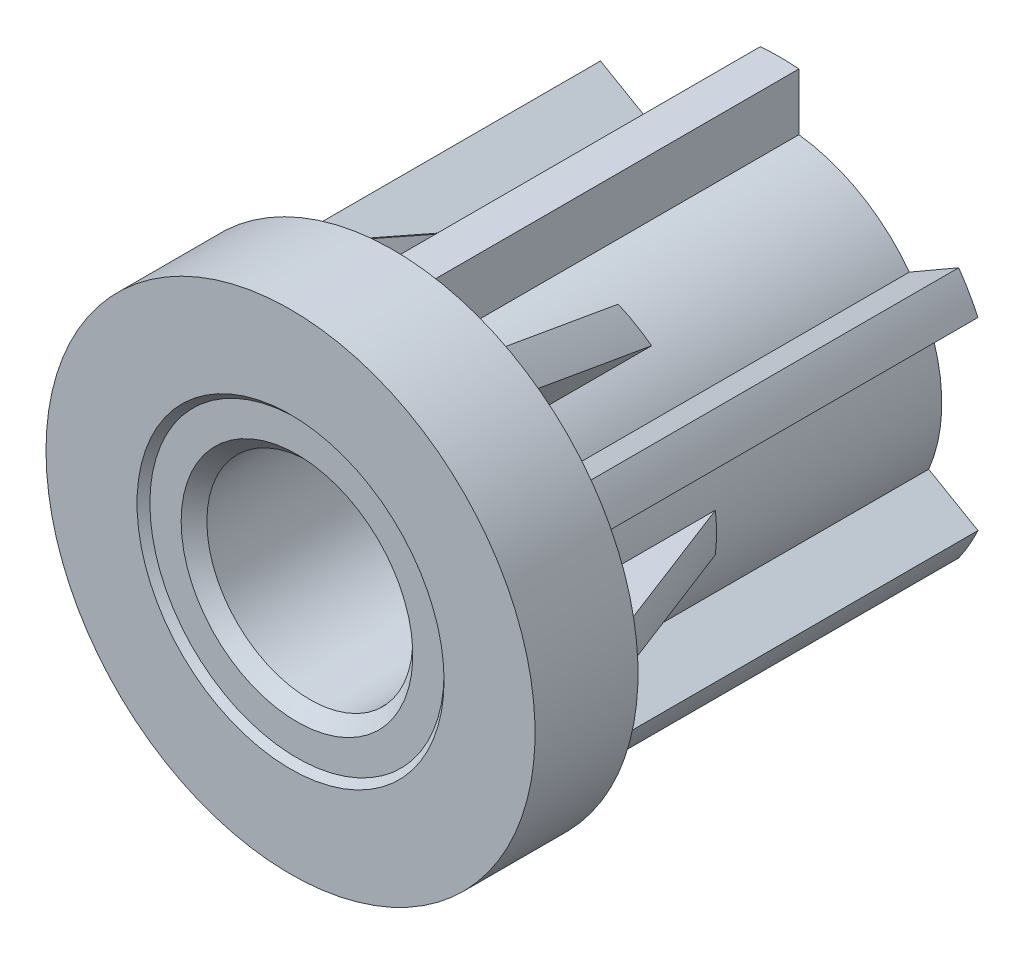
ISO-10303-21;
HEADER;
FILE_DESCRIPTION(('STEP AP214'),'2;1');
FILE_NAME('part.step','',(''),(''),'','','');
FILE_SCHEMA(('AUTOMOTIVE_DESIGN { 1 0 10303 214 1 1 1 1 }'));
ENDSEC;
DATA;
#1=APPLICATION_CONTEXT('core data for automotive mechanical design processes');
#2=APPLICATION_PROTOCOL_DEFINITION('international standard','automotive_design',2000,#1);
#3=PRODUCT_CONTEXT('',#1,'mechanical');
#4=PRODUCT('Part','Part','',(#3));
#5=PRODUCT_RELATED_PRODUCT_CATEGORY('part','',(#4));
#6=PRODUCT_DEFINITION_FORMATION('','',#4);
#7=PRODUCT_DEFINITION_CONTEXT('part definition',#1,'design');
#8=PRODUCT_DEFINITION('design','',#6,#7);
#9=PRODUCT_DEFINITION_SHAPE('','',#8);
#10=(LENGTH_UNIT() NAMED_UNIT(*) SI_UNIT(.MILLI.,.METRE.));
#11=(NAMED_UNIT(*) PLANE_ANGLE_UNIT() SI_UNIT($,.RADIAN.));
#12=(NAMED_UNIT(*) SI_UNIT($,.STERADIAN.) SOLID_ANGLE_UNIT());
#13=UNCERTAINTY_MEASURE_WITH_UNIT(LENGTH_MEASURE(1.E-05),#10,'distance_accuracy_value','');
#14=(GEOMETRIC_REPRESENTATION_CONTEXT(3) GLOBAL_UNCERTAINTY_ASSIGNED_CONTEXT((#13)) GLOBAL_UNIT_ASSIGNED_CONTEXT((#10,
#11,#12)) REPRESENTATION_CONTEXT('',''));
#15=CARTESIAN_POINT('',(0.,0.,0.));
#16=DIRECTION('',(0.,0.,1.));
#17=DIRECTION('',(1.,0.,0.));
#18=AXIS2_PLACEMENT_3D('',#15,#16,#17);
#19=CARTESIAN_POINT('',(0.,0.,-11.));
#20=DIRECTION('',(0.,0.,-1.));
#21=DIRECTION('',(-1.,0.,0.));
#22=AXIS2_PLACEMENT_3D('',#19,#20,#21);
#23=CYLINDRICAL_SURFACE('',#22,9.25);
#24=CARTESIAN_POINT('',(0.,0.,-15.));
#25=DIRECTION('',(0.,0.,-1.));
#26=DIRECTION('',(-1.,0.,0.));
#27=AXIS2_PLACEMENT_3D('',#24,#25,#26);
#28=CIRCLE('',#27,9.25);
#29=CARTESIAN_POINT('',(-9.25,0.,-15.));
#30=VERTEX_POINT('',#29);
#31=EDGE_CURVE('E1473',#30,#30,#28,.T.);
#32=ORIENTED_EDGE('',*,*,#31,.T.);
#33=EDGE_LOOP('',(#32));
#34=FACE_BOUND('',#33,.T.);
#35=CARTESIAN_POINT('',(0.,0.,-7.));
#36=DIRECTION('',(0.,0.,-1.));
#37=DIRECTION('',(-1.,0.,0.));
#38=AXIS2_PLACEMENT_3D('',#35,#36,#37);
#39=CIRCLE('',#38,9.25);
#40=CARTESIAN_POINT('',(-9.25,0.,-7.));
#41=VERTEX_POINT('',#40);
#42=EDGE_CURVE('E1478',#41,#41,#39,.F.);
#43=ORIENTED_EDGE('',*,*,#42,.T.);
#44=EDGE_LOOP('',(#43));
#45=FACE_BOUND('',#44,.T.);
#46=ADVANCED_FACE('F14',(#34,#45),#23,.F.);
#47=CARTESIAN_POINT('',(0.,8.625,-7.));
#48=DIRECTION('',(0.,0.,1.));
#49=DIRECTION('',(1.,0.,0.));
#50=AXIS2_PLACEMENT_3D('',#47,#48,#49);
#51=PLANE('',#50);
#52=ORIENTED_EDGE('',*,*,#42,.F.);
#53=EDGE_LOOP('',(#52));
#54=FACE_BOUND('',#53,.T.);
#55=CARTESIAN_POINT('',(0.,0.,-7.));
#56=DIRECTION('',(0.,0.,-1.));
#57=DIRECTION('',(-1.,0.,0.));
#58=AXIS2_PLACEMENT_3D('',#55,#56,#57);
#59=CIRCLE('',#58,8.);
#60=CARTESIAN_POINT('',(-8.,0.,-7.));
#61=VERTEX_POINT('',#60);
#62=EDGE_CURVE('E1471',#61,#61,#59,.F.);
#63=ORIENTED_EDGE('',*,*,#62,.T.);
#64=EDGE_LOOP('',(#63));
#65=FACE_BOUND('',#64,.T.);
#66=ADVANCED_FACE('F1398',(#54,#65),#51,.F.);
#67=CARTESIAN_POINT('',(0.,9.875,-15.));
#68=DIRECTION('',(0.,0.,1.));
#69=DIRECTION('',(1.,0.,0.));
#70=AXIS2_PLACEMENT_3D('',#67,#68,#69);
#71=PLANE('',#70);
#72=CARTESIAN_POINT('',(0.,0.,-15.));
#73=DIRECTION('',(0.,0.,-1.));
#74=DIRECTION('',(-1.,0.,0.));
#75=AXIS2_PLACEMENT_3D('',#72,#73,#74);
#76=CIRCLE('',#75,10.5);
#77=CARTESIAN_POINT('',(-10.5,0.,-15.));
#78=VERTEX_POINT('',#77);
#79=EDGE_CURVE('E1468',#78,#78,#76,.T.);
#80=ORIENTED_EDGE('',*,*,#79,.T.);
#81=EDGE_LOOP('',(#80));
#82=FACE_BOUND('',#81,.T.);
#83=ORIENTED_EDGE('',*,*,#31,.F.);
#84=EDGE_LOOP('',(#83));
#85=FACE_BOUND('',#84,.T.);
#86=ADVANCED_FACE('F1407',(#82,#85),#71,.F.);
#87=CARTESIAN_POINT('',(0.,0.,-22.5));
#88=DIRECTION('',(0.,0.,-1.));
#89=DIRECTION('',(-1.,0.,0.));
#90=AXIS2_PLACEMENT_3D('',#87,#88,#89);
#91=CYLINDRICAL_SURFACE('',#90,10.5);
#92=ORIENTED_EDGE('',*,*,#79,.F.);
#93=EDGE_LOOP('',(#92));
#94=FACE_BOUND('',#93,.T.);
#95=CARTESIAN_POINT('',(0.,0.,-30.));
#96=DIRECTION('',(0.,0.,-1.));
#97=DIRECTION('',(-1.,0.,0.));
#98=AXIS2_PLACEMENT_3D('',#95,#96,#97);
#99=CIRCLE('',#98,10.5);
#100=CARTESIAN_POINT('',(-10.5,0.,-30.));
#101=VERTEX_POINT('',#100);
#102=EDGE_CURVE('E694',#101,#101,#99,.F.);
#103=ORIENTED_EDGE('',*,*,#102,.F.);
#104=EDGE_LOOP('',(#103));
#105=FACE_BOUND('',#104,.T.);
#106=ADVANCED_FACE('F1417',(#94,#105),#91,.F.);
#107=CARTESIAN_POINT('',(0.,0.,-1.));
#108=DIRECTION('',(0.,0.,1.));
#109=DIRECTION('',(1.,0.,0.));
#110=AXIS2_PLACEMENT_3D('',#107,#108,#109);
#111=CONICAL_SURFACE('',#110,17.,0.365424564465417);
#112=CARTESIAN_POINT('',(-16.9336942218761,-1.5,-1.));
#113=CARTESIAN_POINT('',(-16.5655249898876,-1.5,-1.95850213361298));
#114=CARTESIAN_POINT('',(-16.197277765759,-1.5,-2.9169743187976));
#115=CARTESIAN_POINT('',(-15.4605829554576,-1.5,-4.83384160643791));
#116=CARTESIAN_POINT('',(-15.0921353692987,-1.5,-5.79223670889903));
#117=CARTESIAN_POINT('',(-14.3549953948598,-1.5,-7.70893280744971));
#118=CARTESIAN_POINT('',(-13.9863030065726,-1.5,-8.66723380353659));
#119=CARTESIAN_POINT('',(-13.2486031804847,-1.5,-10.5837145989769));
#120=CARTESIAN_POINT('',(-12.8795957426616,-1.5,-11.5418943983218));
#121=CARTESIAN_POINT('',(-12.5103956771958,-1.5,-12.5));
#122=B_SPLINE_CURVE_WITH_KNOTS('',3,(#112,#113,#114,#115,#116,#117,#118,#119,#120,#121),
.UNSPECIFIED.,.F.,.F.,(4,2,2,2,4),(0.,3.08033672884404,6.16067324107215,9.24100984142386,
12.3213466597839),.UNSPECIFIED.);
#123=CARTESIAN_POINT('',(-16.9336942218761,-1.5,-1.));
#124=VERTEX_POINT('',#123);
#125=CARTESIAN_POINT('',(-12.5103956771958,-1.5,-12.5));
#126=VERTEX_POINT('',#125);
#127=EDGE_CURVE('E683',#124,#126,#122,.T.);
#128=ORIENTED_EDGE('',*,*,#127,.F.);
#129=CARTESIAN_POINT('',(-1.88264912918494E-13,1.02140518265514E-13,-1.));
#130=DIRECTION('',(0.,0.,1.));
#131=DIRECTION('',(1.,0.,0.));
#132=AXIS2_PLACEMENT_3D('',#129,#130,#131);
#133=CIRCLE('',#132,17.);
#134=CARTESIAN_POINT('',(-16.9336942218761,1.5,-1.));
#135=VERTEX_POINT('',#134);
#136=EDGE_CURVE('E323',#135,#124,#133,.T.);
#137=ORIENTED_EDGE('',*,*,#136,.F.);
#138=CARTESIAN_POINT('',(-12.5103956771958,1.5,-12.5));
#139=CARTESIAN_POINT('',(-12.8795957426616,1.5,-11.5418943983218));
#140=CARTESIAN_POINT('',(-13.2486031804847,1.5,-10.5837145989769));
#141=CARTESIAN_POINT('',(-13.9863030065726,1.5,-8.66723380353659));
#142=CARTESIAN_POINT('',(-14.3549953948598,1.5,-7.70893280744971));
#143=CARTESIAN_POINT('',(-15.0921353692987,1.5,-5.79223670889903));
#144=CARTESIAN_POINT('',(-15.4605829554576,1.5,-4.83384160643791));
#145=CARTESIAN_POINT('',(-16.197277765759,1.5,-2.9169743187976));
#146=CARTESIAN_POINT('',(-16.5655249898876,1.5,-1.95850213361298));
#147=CARTESIAN_POINT('',(-16.9336942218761,1.5,-1.));
#148=B_SPLINE_CURVE_WITH_KNOTS('',3,(#138,#139,#140,#141,#142,#143,#144,#145,#146,#147),
.UNSPECIFIED.,.F.,.F.,(4,2,2,2,4),(0.,3.08033681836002,6.16067341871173,9.24100993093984,
12.3213466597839),.UNSPECIFIED.);
#149=CARTESIAN_POINT('',(-12.5103956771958,1.5,-12.5));
#150=VERTEX_POINT('',#149);
#151=EDGE_CURVE('E316',#150,#135,#148,.T.);
#152=ORIENTED_EDGE('',*,*,#151,.F.);
#153=CARTESIAN_POINT('',(0.,0.,-12.5));
#154=DIRECTION('',(0.,0.,-1.));
#155=DIRECTION('',(-1.,0.,0.));
#156=AXIS2_PLACEMENT_3D('',#153,#154,#155);
#157=CIRCLE('',#156,12.6);
#158=EDGE_CURVE('E320',#126,#150,#157,.T.);
#159=ORIENTED_EDGE('',*,*,#158,.F.);
#160=EDGE_LOOP('',(#128,#137,#152,#159));
#161=FACE_BOUND('',#160,.T.);
#162=ADVANCED_FACE('F318',(#161),#111,.T.);
#163=CARTESIAN_POINT('',(0.,0.,-1.));
#164=DIRECTION('',(0.,0.,1.));
#165=DIRECTION('',(1.,0.,0.));
#166=AXIS2_PLACEMENT_3D('',#163,#164,#165);
#167=CONICAL_SURFACE('',#166,17.,0.365424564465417);
#168=CARTESIAN_POINT('',(-7.16780900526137,-15.4150093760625,-1.));
#169=CARTESIAN_POINT('',(-6.98372438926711,-15.0961654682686,-1.95850213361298));
#170=CARTESIAN_POINT('',(-6.79960077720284,-14.7772540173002,-2.91697431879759));
#171=CARTESIAN_POINT('',(-6.43125337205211,-14.139257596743,-4.83384160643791));
#172=CARTESIAN_POINT('',(-6.2470295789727,-13.8201726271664,-5.79223670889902));
#173=CARTESIAN_POINT('',(-5.87845959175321,-13.1817906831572,-7.70893280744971));
#174=CARTESIAN_POINT('',(-5.69411339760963,-12.8624937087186,-8.66723380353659));
#175=CARTESIAN_POINT('',(-5.32526348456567,-12.2236269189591,-10.5837145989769));
#176=CARTESIAN_POINT('',(-5.14075976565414,-11.9040571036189,-11.5418943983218));
#177=CARTESIAN_POINT('',(-4.95615973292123,-11.5843204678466,-12.5));
#178=B_SPLINE_CURVE_WITH_KNOTS('',3,(#168,#169,#170,#171,#172,#173,#174,#175,#176,#177),
.UNSPECIFIED.,.F.,.F.,(4,2,2,2,4),(0.,3.08033672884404,6.16067324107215,9.24100984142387,
12.3213466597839),.UNSPECIFIED.);
#179=CARTESIAN_POINT('',(-7.16780900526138,-15.4150093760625,-1.));
#180=VERTEX_POINT('',#179);
#181=CARTESIAN_POINT('',(-4.95615973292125,-11.5843204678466,-12.5));
#182=VERTEX_POINT('',#181);
#183=EDGE_CURVE('E634',#180,#182,#178,.T.);
#184=ORIENTED_EDGE('',*,*,#183,.F.);
#185=CARTESIAN_POINT('',(-4.35178513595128E-13,-7.99360577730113E-13,-1.));
#186=DIRECTION('',(0.,0.,1.));
#187=DIRECTION('',(1.,0.,0.));
#188=AXIS2_PLACEMENT_3D('',#185,#186,#187);
#189=CIRCLE('',#188,16.9999999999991);
#190=CARTESIAN_POINT('',(-9.7658852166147,-13.9150093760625,-1.));
#191=VERTEX_POINT('',#190);
#192=EDGE_CURVE('E650',#191,#180,#189,.T.);
#193=ORIENTED_EDGE('',*,*,#192,.F.);
#194=CARTESIAN_POINT('',(-7.55423594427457,-10.0843204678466,-12.5));
#195=CARTESIAN_POINT('',(-7.73883597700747,-10.4040571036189,-11.5418943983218));
#196=CARTESIAN_POINT('',(-7.923339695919,-10.723626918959,-10.5837145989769));
#197=CARTESIAN_POINT('',(-8.29218960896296,-11.3624937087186,-8.6672338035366));
#198=CARTESIAN_POINT('',(-8.47653580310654,-11.6817906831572,-7.70893280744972));
#199=CARTESIAN_POINT('',(-8.84510579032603,-12.3201726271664,-5.79223670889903));
#200=CARTESIAN_POINT('',(-9.02932958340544,-12.6392575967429,-4.83384160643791));
#201=CARTESIAN_POINT('',(-9.39767698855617,-13.2772540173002,-2.9169743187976));
#202=CARTESIAN_POINT('',(-9.58180060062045,-13.5961654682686,-1.95850213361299));
#203=CARTESIAN_POINT('',(-9.76588521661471,-13.9150093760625,-1.));
#204=B_SPLINE_CURVE_WITH_KNOTS('',3,(#194,#195,#196,#197,#198,#199,#200,#201,#202,#203),
.UNSPECIFIED.,.F.,.F.,(4,2,2,2,4),(0.,3.08033681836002,6.16067341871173,9.24100993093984,
12.3213466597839),.UNSPECIFIED.);
#205=CARTESIAN_POINT('',(-7.55423594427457,-10.0843204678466,-12.5));
#206=VERTEX_POINT('',#205);
#207=EDGE_CURVE('E642',#206,#191,#204,.T.);
#208=ORIENTED_EDGE('',*,*,#207,.F.);
#209=CARTESIAN_POINT('',(0.,0.,-12.5));
#210=DIRECTION('',(0.,0.,-1.));
#211=DIRECTION('',(-1.,0.,0.));
#212=AXIS2_PLACEMENT_3D('',#209,#210,#211);
#213=CIRCLE('',#212,12.6);
#214=EDGE_CURVE('E855',#182,#206,#213,.T.);
#215=ORIENTED_EDGE('',*,*,#214,.F.);
#216=EDGE_LOOP('',(#184,#193,#208,#215));
#217=FACE_BOUND('',#216,.T.);
#218=ADVANCED_FACE('F623',(#217),#167,.T.);
#219=CARTESIAN_POINT('',(0.,0.,-1.));
#220=DIRECTION('',(0.,0.,1.));
#221=DIRECTION('',(1.,0.,0.));
#222=AXIS2_PLACEMENT_3D('',#219,#220,#221);
#223=CONICAL_SURFACE('',#222,17.,0.365424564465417);
#224=CARTESIAN_POINT('',(9.76588521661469,-13.9150093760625,-1.));
#225=CARTESIAN_POINT('',(9.58180060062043,-13.5961654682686,-1.95850213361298));
#226=CARTESIAN_POINT('',(9.39767698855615,-13.2772540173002,-2.9169743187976));
#227=CARTESIAN_POINT('',(9.02932958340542,-12.639257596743,-4.83384160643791));
#228=CARTESIAN_POINT('',(8.84510579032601,-12.3201726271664,-5.79223670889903));
#229=CARTESIAN_POINT('',(8.47653580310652,-11.6817906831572,-7.70893280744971));
#230=CARTESIAN_POINT('',(8.29218960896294,-11.3624937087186,-8.66723380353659));
#231=CARTESIAN_POINT('',(7.92333969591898,-10.7236269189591,-10.5837145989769));
#232=CARTESIAN_POINT('',(7.73883597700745,-10.4040571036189,-11.5418943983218));
#233=CARTESIAN_POINT('',(7.55423594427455,-10.0843204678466,-12.5));
#234=B_SPLINE_CURVE_WITH_KNOTS('',3,(#224,#225,#226,#227,#228,#229,#230,#231,#232,#233),
.UNSPECIFIED.,.F.,.F.,(4,2,2,2,4),(0.,3.08033672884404,6.16067324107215,9.24100984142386,
12.3213466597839),.UNSPECIFIED.);
#235=CARTESIAN_POINT('',(9.76588521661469,-13.9150093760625,-1.));
#236=VERTEX_POINT('',#235);
#237=CARTESIAN_POINT('',(7.55423594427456,-10.0843204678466,-12.5));
#238=VERTEX_POINT('',#237);
#239=EDGE_CURVE('E604',#236,#238,#234,.T.);
#240=ORIENTED_EDGE('',*,*,#239,.F.);
#241=CARTESIAN_POINT('',(0.,0.,-1.));
#242=DIRECTION('',(0.,0.,1.));
#243=DIRECTION('',(1.,0.,0.));
#244=AXIS2_PLACEMENT_3D('',#241,#242,#243);
#245=CIRCLE('',#244,17.);
#246=CARTESIAN_POINT('',(7.16780900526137,-15.4150093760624,-1.));
#247=VERTEX_POINT('',#246);
#248=EDGE_CURVE('E835',#247,#236,#245,.T.);
#249=ORIENTED_EDGE('',*,*,#248,.F.);
#250=CARTESIAN_POINT('',(4.95615973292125,-11.5843204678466,-12.5));
#251=CARTESIAN_POINT('',(5.14075976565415,-11.9040571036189,-11.5418943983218));
#252=CARTESIAN_POINT('',(5.32526348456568,-12.223626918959,-10.5837145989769));
#253=CARTESIAN_POINT('',(5.69411339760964,-12.8624937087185,-8.6672338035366));
#254=CARTESIAN_POINT('',(5.87845959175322,-13.1817906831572,-7.70893280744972));
#255=CARTESIAN_POINT('',(6.24702957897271,-13.8201726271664,-5.79223670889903));
#256=CARTESIAN_POINT('',(6.43125337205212,-14.139257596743,-4.83384160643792));
#257=CARTESIAN_POINT('',(6.79960077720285,-14.7772540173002,-2.9169743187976));
#258=CARTESIAN_POINT('',(6.98372438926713,-15.0961654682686,-1.95850213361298));
#259=CARTESIAN_POINT('',(7.16780900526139,-15.4150093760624,-1.));
#260=B_SPLINE_CURVE_WITH_KNOTS('',3,(#250,#251,#252,#253,#254,#255,#256,#257,#258,#259),
.UNSPECIFIED.,.F.,.F.,(4,2,2,2,4),(0.,3.08033681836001,6.16067341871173,9.24100993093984,
12.3213466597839),.UNSPECIFIED.);
#261=CARTESIAN_POINT('',(4.95615973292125,-11.5843204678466,-12.5));
#262=VERTEX_POINT('',#261);
#263=EDGE_CURVE('E613',#262,#247,#260,.T.);
#264=ORIENTED_EDGE('',*,*,#263,.F.);
#265=CARTESIAN_POINT('',(0.,0.,-12.5));
#266=DIRECTION('',(0.,0.,-1.));
#267=DIRECTION('',(-1.,0.,0.));
#268=AXIS2_PLACEMENT_3D('',#265,#266,#267);
#269=CIRCLE('',#268,12.6);
#270=EDGE_CURVE('E829',#238,#262,#269,.T.);
#271=ORIENTED_EDGE('',*,*,#270,.F.);
#272=EDGE_LOOP('',(#240,#249,#264,#271));
#273=FACE_BOUND('',#272,.T.);
#274=ADVANCED_FACE('F619',(#273),#223,.T.);
#275=CARTESIAN_POINT('',(0.,0.,-0.99999999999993));
#276=DIRECTION('',(0.,0.,1.));
#277=DIRECTION('',(1.,0.,0.));
#278=AXIS2_PLACEMENT_3D('',#275,#276,#277);
#279=CONICAL_SURFACE('',#278,17.,0.365424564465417);
#280=CARTESIAN_POINT('',(12.5103956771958,-1.5,-12.5));
#281=CARTESIAN_POINT('',(12.8795957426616,-1.5,-11.5418943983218));
#282=CARTESIAN_POINT('',(13.2486031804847,-1.5,-10.5837145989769));
#283=CARTESIAN_POINT('',(13.9863030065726,-1.5,-8.66723380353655));
#284=CARTESIAN_POINT('',(14.3549953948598,-1.5,-7.70893280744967));
#285=CARTESIAN_POINT('',(15.0921353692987,-1.5,-5.79223670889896));
#286=CARTESIAN_POINT('',(15.4605829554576,-1.5,-4.83384160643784));
#287=CARTESIAN_POINT('',(16.197277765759,-1.5,-2.91697431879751));
#288=CARTESIAN_POINT('',(16.5655249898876,-1.5,-1.9585021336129));
#289=CARTESIAN_POINT('',(16.9336942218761,-1.5,-0.999999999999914));
#290=B_SPLINE_CURVE_WITH_KNOTS('',3,(#280,#281,#282,#283,#284,#285,#286,#287,#288,#289),
.UNSPECIFIED.,.F.,.F.,(4,2,2,2,4),(0.,3.08033681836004,6.16067341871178,9.24100993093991,
12.321346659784),.UNSPECIFIED.);
#291=CARTESIAN_POINT('',(12.5103956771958,-1.5,-12.5));
#292=VERTEX_POINT('',#291);
#293=CARTESIAN_POINT('',(16.9336942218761,-1.5,-0.999999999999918));
#294=VERTEX_POINT('',#293);
#295=EDGE_CURVE('E564',#292,#294,#290,.T.);
#296=ORIENTED_EDGE('',*,*,#295,.F.);
#297=CARTESIAN_POINT('',(0.,0.,-12.5));
#298=DIRECTION('',(0.,0.,-1.));
#299=DIRECTION('',(-1.,0.,0.));
#300=AXIS2_PLACEMENT_3D('',#297,#298,#299);
#301=CIRCLE('',#300,12.6);
#302=CARTESIAN_POINT('',(12.5103956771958,1.5,-12.5));
#303=VERTEX_POINT('',#302);
#304=EDGE_CURVE('E805',#303,#292,#301,.T.);
#305=ORIENTED_EDGE('',*,*,#304,.F.);
#306=CARTESIAN_POINT('',(16.9336942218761,1.5,-0.999999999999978));
#307=CARTESIAN_POINT('',(16.5655249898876,1.5,-1.95850213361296));
#308=CARTESIAN_POINT('',(16.197277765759,1.5,-2.91697431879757));
#309=CARTESIAN_POINT('',(15.4605829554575,1.5,-4.83384160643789));
#310=CARTESIAN_POINT('',(15.0921353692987,1.5,-5.79223670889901));
#311=CARTESIAN_POINT('',(14.3549953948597,1.5,-7.7089328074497));
#312=CARTESIAN_POINT('',(13.9863030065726,1.5,-8.66723380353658));
#313=CARTESIAN_POINT('',(13.2486031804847,1.5,-10.5837145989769));
#314=CARTESIAN_POINT('',(12.8795957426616,1.5,-11.5418943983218));
#315=CARTESIAN_POINT('',(12.5103956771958,1.5,-12.5));
#316=B_SPLINE_CURVE_WITH_KNOTS('',3,(#306,#307,#308,#309,#310,#311,#312,#313,#314,#315),
.UNSPECIFIED.,.F.,.F.,(4,2,2,2,4),(0.,3.08033672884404,6.16067324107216,9.24100984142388,
12.3213466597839),.UNSPECIFIED.);
#317=CARTESIAN_POINT('',(16.9336942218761,1.5,-0.999999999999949));
#318=VERTEX_POINT('',#317);
#319=EDGE_CURVE('E555',#318,#303,#316,.T.);
#320=ORIENTED_EDGE('',*,*,#319,.F.);
#321=CARTESIAN_POINT('',(1.67006454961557E-13,-1.96509475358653E-13,-0.999999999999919));
#322=DIRECTION('',(0.,0.,1.));
#323=DIRECTION('',(1.,0.,0.));
#324=AXIS2_PLACEMENT_3D('',#321,#322,#323);
#325=CIRCLE('',#324,17.);
#326=EDGE_CURVE('E571',#294,#318,#325,.T.);
#327=ORIENTED_EDGE('',*,*,#326,.F.);
#328=EDGE_LOOP('',(#296,#305,#320,#327));
#329=FACE_BOUND('',#328,.T.);
#330=ADVANCED_FACE('F498',(#329),#279,.T.);
#331=CARTESIAN_POINT('',(0.,0.,-1.));
#332=DIRECTION('',(0.,0.,1.));
#333=DIRECTION('',(1.,0.,0.));
#334=AXIS2_PLACEMENT_3D('',#331,#332,#333);
#335=CONICAL_SURFACE('',#334,17.,0.365424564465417);
#336=CARTESIAN_POINT('',(7.16780900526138,15.4150093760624,-0.999999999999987));
#337=CARTESIAN_POINT('',(6.98372438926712,15.0961654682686,-1.95850213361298));
#338=CARTESIAN_POINT('',(6.79960077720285,14.7772540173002,-2.91697431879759));
#339=CARTESIAN_POINT('',(6.43125337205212,14.139257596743,-4.83384160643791));
#340=CARTESIAN_POINT('',(6.2470295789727,13.8201726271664,-5.79223670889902));
#341=CARTESIAN_POINT('',(5.87845959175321,13.1817906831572,-7.70893280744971));
#342=CARTESIAN_POINT('',(5.69411339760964,12.8624937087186,-8.66723380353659));
#343=CARTESIAN_POINT('',(5.32526348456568,12.2236269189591,-10.5837145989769));
#344=CARTESIAN_POINT('',(5.14075976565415,11.9040571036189,-11.5418943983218));
#345=CARTESIAN_POINT('',(4.95615973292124,11.5843204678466,-12.5));
#346=B_SPLINE_CURVE_WITH_KNOTS('',3,(#336,#337,#338,#339,#340,#341,#342,#343,#344,#345),
.UNSPECIFIED.,.F.,.F.,(4,2,2,2,4),(0.,3.08033672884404,6.16067324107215,9.24100984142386,
12.3213466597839),.UNSPECIFIED.);
#347=CARTESIAN_POINT('',(7.16780900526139,15.4150093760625,-1.));
#348=VERTEX_POINT('',#347);
#349=CARTESIAN_POINT('',(4.95615973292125,11.5843204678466,-12.5));
#350=VERTEX_POINT('',#349);
#351=EDGE_CURVE('E504',#348,#350,#346,.T.);
#352=ORIENTED_EDGE('',*,*,#351,.F.);
#353=CARTESIAN_POINT('',(-6.42124085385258E-13,-6.48370246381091E-13,-1.));
#354=DIRECTION('',(0.,0.,1.));
#355=DIRECTION('',(1.,0.,0.));
#356=AXIS2_PLACEMENT_3D('',#353,#354,#355);
#357=CIRCLE('',#356,17.0000000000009);
#358=CARTESIAN_POINT('',(9.76588521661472,13.9150093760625,-1.));
#359=VERTEX_POINT('',#358);
#360=EDGE_CURVE('E520',#359,#348,#357,.T.);
#361=ORIENTED_EDGE('',*,*,#360,.F.);
#362=CARTESIAN_POINT('',(7.55423594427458,10.0843204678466,-12.5));
#363=CARTESIAN_POINT('',(7.73883597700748,10.4040571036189,-11.5418943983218));
#364=CARTESIAN_POINT('',(7.92333969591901,10.723626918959,-10.5837145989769));
#365=CARTESIAN_POINT('',(8.29218960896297,11.3624937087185,-8.66723380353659));
#366=CARTESIAN_POINT('',(8.47653580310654,11.6817906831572,-7.70893280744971));
#367=CARTESIAN_POINT('',(8.84510579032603,12.3201726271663,-5.79223670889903));
#368=CARTESIAN_POINT('',(9.02932958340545,12.6392575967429,-4.83384160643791));
#369=CARTESIAN_POINT('',(9.39767698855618,13.2772540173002,-2.9169743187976));
#370=CARTESIAN_POINT('',(9.58180060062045,13.5961654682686,-1.95850213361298));
#371=CARTESIAN_POINT('',(9.76588521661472,13.9150093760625,-1.));
#372=B_SPLINE_CURVE_WITH_KNOTS('',3,(#362,#363,#364,#365,#366,#367,#368,#369,#370,#371),
.UNSPECIFIED.,.F.,.F.,(4,2,2,2,4),(0.,3.08033681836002,6.16067341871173,9.24100993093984,
12.3213466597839),.UNSPECIFIED.);
#373=CARTESIAN_POINT('',(7.55423594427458,10.0843204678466,-12.5));
#374=VERTEX_POINT('',#373);
#375=EDGE_CURVE('E512',#374,#359,#372,.T.);
#376=ORIENTED_EDGE('',*,*,#375,.F.);
#377=CARTESIAN_POINT('',(0.,0.,-12.5));
#378=DIRECTION('',(0.,0.,-1.));
#379=DIRECTION('',(-1.,0.,0.));
#380=AXIS2_PLACEMENT_3D('',#377,#378,#379);
#381=CIRCLE('',#380,12.6);
#382=EDGE_CURVE('E780',#350,#374,#381,.T.);
#383=ORIENTED_EDGE('',*,*,#382,.F.);
#384=EDGE_LOOP('',(#352,#361,#376,#383));
#385=FACE_BOUND('',#384,.T.);
#386=ADVANCED_FACE('F491',(#385),#335,.T.);
#387=CARTESIAN_POINT('',(0.,0.,-1.));
#388=DIRECTION('',(0.,0.,1.));
#389=DIRECTION('',(1.,0.,0.));
#390=AXIS2_PLACEMENT_3D('',#387,#388,#389);
#391=CONICAL_SURFACE('',#390,17.,0.365424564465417);
#392=CARTESIAN_POINT('',(-9.7658852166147,13.9150093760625,-1.));
#393=CARTESIAN_POINT('',(-9.58180060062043,13.5961654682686,-1.95850213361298));
#394=CARTESIAN_POINT('',(-9.39767698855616,13.2772540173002,-2.91697431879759));
#395=CARTESIAN_POINT('',(-9.02932958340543,12.639257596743,-4.83384160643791));
#396=CARTESIAN_POINT('',(-8.84510579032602,12.3201726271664,-5.79223670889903));
#397=CARTESIAN_POINT('',(-8.47653580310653,11.6817906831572,-7.70893280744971));
#398=CARTESIAN_POINT('',(-8.29218960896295,11.3624937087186,-8.66723380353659));
#399=CARTESIAN_POINT('',(-7.92333969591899,10.7236269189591,-10.5837145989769));
#400=CARTESIAN_POINT('',(-7.73883597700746,10.4040571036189,-11.5418943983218));
#401=CARTESIAN_POINT('',(-7.55423594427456,10.0843204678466,-12.5));
#402=B_SPLINE_CURVE_WITH_KNOTS('',3,(#392,#393,#394,#395,#396,#397,#398,#399,#400,#401),
.UNSPECIFIED.,.F.,.F.,(4,2,2,2,4),(0.,3.08033672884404,6.16067324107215,9.24100984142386,
12.3213466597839),.UNSPECIFIED.);
#403=CARTESIAN_POINT('',(-9.7658852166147,13.9150093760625,-1.));
#404=VERTEX_POINT('',#403);
#405=CARTESIAN_POINT('',(-7.55423594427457,10.0843204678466,-12.5));
#406=VERTEX_POINT('',#405);
#407=EDGE_CURVE('E464',#404,#406,#402,.T.);
#408=ORIENTED_EDGE('',*,*,#407,.F.);
#409=CARTESIAN_POINT('',(-2.326738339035E-13,1.11910480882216E-13,-1.));
#410=DIRECTION('',(0.,0.,1.));
#411=DIRECTION('',(1.,0.,0.));
#412=AXIS2_PLACEMENT_3D('',#409,#410,#411);
#413=CIRCLE('',#412,17.);
#414=CARTESIAN_POINT('',(-7.16780900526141,15.4150093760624,-1.));
#415=VERTEX_POINT('',#414);
#416=EDGE_CURVE('E888',#415,#404,#413,.T.);
#417=ORIENTED_EDGE('',*,*,#416,.F.);
#418=CARTESIAN_POINT('',(-4.95615973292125,11.5843204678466,-12.5));
#419=CARTESIAN_POINT('',(-5.14075976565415,11.9040571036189,-11.5418943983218));
#420=CARTESIAN_POINT('',(-5.32526348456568,12.223626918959,-10.5837145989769));
#421=CARTESIAN_POINT('',(-5.69411339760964,12.8624937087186,-8.6672338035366));
#422=CARTESIAN_POINT('',(-5.87845959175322,13.1817906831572,-7.70893280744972));
#423=CARTESIAN_POINT('',(-6.24702957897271,13.8201726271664,-5.79223670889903));
#424=CARTESIAN_POINT('',(-6.43125337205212,14.139257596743,-4.83384160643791));
#425=CARTESIAN_POINT('',(-6.79960077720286,14.7772540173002,-2.9169743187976));
#426=CARTESIAN_POINT('',(-6.98372438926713,15.0961654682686,-1.95850213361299));
#427=CARTESIAN_POINT('',(-7.1678090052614,15.4150093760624,-1.));
#428=B_SPLINE_CURVE_WITH_KNOTS('',3,(#418,#419,#420,#421,#422,#423,#424,#425,#426,#427),
.UNSPECIFIED.,.F.,.F.,(4,2,2,2,4),(0.,3.08033681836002,6.16067341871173,9.24100993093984,
12.3213466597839),.UNSPECIFIED.);
#429=CARTESIAN_POINT('',(-4.95615973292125,11.5843204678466,-12.5));
#430=VERTEX_POINT('',#429);
#431=EDGE_CURVE('E474',#430,#415,#428,.T.);
#432=ORIENTED_EDGE('',*,*,#431,.F.);
#433=CARTESIAN_POINT('',(0.,0.,-12.5));
#434=DIRECTION('',(0.,0.,-1.));
#435=DIRECTION('',(-1.,0.,0.));
#436=AXIS2_PLACEMENT_3D('',#433,#434,#435);
#437=CIRCLE('',#436,12.6);
#438=EDGE_CURVE('E760',#406,#430,#437,.T.);
#439=ORIENTED_EDGE('',*,*,#438,.F.);
#440=EDGE_LOOP('',(#408,#417,#432,#439));
#441=FACE_BOUND('',#440,.T.);
#442=ADVANCED_FACE('F485',(#441),#391,.T.);
#443=CARTESIAN_POINT('',(0.,6.3,-30.));
#444=DIRECTION('',(0.,0.,-1.));
#445=DIRECTION('',(-1.,0.,0.));
#446=AXIS2_PLACEMENT_3D('',#443,#444,#445);
#447=PLANE('',#446);
#448=ORIENTED_EDGE('',*,*,#102,.T.);
#449=EDGE_LOOP('',(#448));
#450=FACE_BOUND('',#449,.T.);
#451=CARTESIAN_POINT('',(0.,0.,-30.));
#452=DIRECTION('',(0.,0.,1.));
#453=DIRECTION('',(1.,0.,0.));
#454=AXIS2_PLACEMENT_3D('',#451,#452,#453);
#455=CIRCLE('',#454,17.);
#456=CARTESIAN_POINT('',(-13.9150093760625,9.7658852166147,-30.));
#457=VERTEX_POINT('',#456);
#458=CARTESIAN_POINT('',(-15.4150093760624,7.16780900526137,-30.));
#459=VERTEX_POINT('',#458);
#460=EDGE_CURVE('E456',#457,#459,#455,.T.);
#461=ORIENTED_EDGE('',*,*,#460,.F.);
#462=DIRECTION('',(0.866025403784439,-0.5,0.));
#463=VECTOR('',#462,1.);
#464=CARTESIAN_POINT('',(-6.9352130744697,5.73609794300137,-30.));
#465=LINE('',#464,#463);
#466=CARTESIAN_POINT('',(-10.0843204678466,7.55423594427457,-30.));
#467=VERTEX_POINT('',#466);
#468=EDGE_CURVE('E882',#467,#457,#465,.F.);
#469=ORIENTED_EDGE('',*,*,#468,.F.);
#470=CARTESIAN_POINT('',(0.,0.,-30.));
#471=DIRECTION('',(0.,0.,-1.));
#472=DIRECTION('',(-1.,0.,0.));
#473=AXIS2_PLACEMENT_3D('',#470,#471,#472);
#474=CIRCLE('',#473,12.6);
#475=CARTESIAN_POINT('',(-1.5,12.5103956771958,-30.));
#476=VERTEX_POINT('',#475);
#477=EDGE_CURVE('E460',#476,#467,#474,.F.);
#478=ORIENTED_EDGE('',*,*,#477,.F.);
#479=DIRECTION('',(0.,1.,0.));
#480=VECTOR('',#479,1.);
#481=CARTESIAN_POINT('',(-1.5,16.9336942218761,-30.));
#482=LINE('',#481,#480);
#483=CARTESIAN_POINT('',(-1.5,16.9336942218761,-30.));
#484=VERTEX_POINT('',#483);
#485=EDGE_CURVE('E767',#484,#476,#482,.F.);
#486=ORIENTED_EDGE('',*,*,#485,.F.);
#487=CARTESIAN_POINT('',(2.44450293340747E-13,6.32383034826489E-13,-30.));
#488=DIRECTION('',(0.,0.,1.));
#489=DIRECTION('',(1.,0.,0.));
#490=AXIS2_PLACEMENT_3D('',#487,#488,#489);
#491=CIRCLE('',#490,16.9999999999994);
#492=CARTESIAN_POINT('',(1.5,16.9336942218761,-30.));
#493=VERTEX_POINT('',#492);
#494=EDGE_CURVE('E768',#493,#484,#491,.T.);
#495=ORIENTED_EDGE('',*,*,#494,.F.);
#496=DIRECTION('',(0.,-1.,0.));
#497=VECTOR('',#496,1.);
#498=CARTESIAN_POINT('',(1.5,8.87411967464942,-30.));
#499=LINE('',#498,#497);
#500=CARTESIAN_POINT('',(1.5,12.5103956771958,-30.));
#501=VERTEX_POINT('',#500);
#502=EDGE_CURVE('E772',#501,#493,#499,.F.);
#503=ORIENTED_EDGE('',*,*,#502,.F.);
#504=CARTESIAN_POINT('',(0.,0.,-30.));
#505=DIRECTION('',(0.,0.,-1.));
#506=DIRECTION('',(-1.,0.,0.));
#507=AXIS2_PLACEMENT_3D('',#504,#505,#506);
#508=CIRCLE('',#507,12.6);
#509=CARTESIAN_POINT('',(10.0843204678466,7.55423594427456,-30.));
#510=VERTEX_POINT('',#509);
#511=EDGE_CURVE('E776',#510,#501,#508,.F.);
#512=ORIENTED_EDGE('',*,*,#511,.F.);
#513=DIRECTION('',(0.866025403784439,0.5,0.));
#514=VECTOR('',#513,1.);
#515=CARTESIAN_POINT('',(13.9150093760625,9.7658852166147,-30.));
#516=LINE('',#515,#514);
#517=CARTESIAN_POINT('',(13.9150093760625,9.7658852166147,-30.));
#518=VERTEX_POINT('',#517);
#519=EDGE_CURVE('E521',#518,#510,#516,.F.);
#520=ORIENTED_EDGE('',*,*,#519,.F.);
#521=CARTESIAN_POINT('',(5.35550770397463E-13,1.66977542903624E-13,-30.));
#522=DIRECTION('',(0.,0.,1.));
#523=DIRECTION('',(1.,0.,0.));
#524=AXIS2_PLACEMENT_3D('',#521,#522,#523);
#525=CIRCLE('',#524,16.9999999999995);
#526=CARTESIAN_POINT('',(15.4150093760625,7.1678090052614,-30.));
#527=VERTEX_POINT('',#526);
#528=EDGE_CURVE('E522',#527,#518,#525,.T.);
#529=ORIENTED_EDGE('',*,*,#528,.F.);
#530=DIRECTION('',(-0.866025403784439,-0.5,0.));
#531=VECTOR('',#530,1.);
#532=CARTESIAN_POINT('',(8.4352130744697,3.13802173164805,-30.));
#533=LINE('',#532,#531);
#534=CARTESIAN_POINT('',(11.5843204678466,4.95615973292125,-30.));
#535=VERTEX_POINT('',#534);
#536=EDGE_CURVE('E798',#535,#527,#533,.F.);
#537=ORIENTED_EDGE('',*,*,#536,.F.);
#538=CARTESIAN_POINT('',(0.,0.,-30.));
#539=DIRECTION('',(0.,0.,-1.));
#540=DIRECTION('',(-1.,0.,0.));
#541=AXIS2_PLACEMENT_3D('',#538,#539,#540);
#542=CIRCLE('',#541,12.6);
#543=CARTESIAN_POINT('',(11.5843204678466,-4.95615973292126,-30.));
#544=VERTEX_POINT('',#543);
#545=EDGE_CURVE('E563',#544,#535,#542,.F.);
#546=ORIENTED_EDGE('',*,*,#545,.F.);
#547=DIRECTION('',(0.866025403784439,-0.5,0.));
#548=VECTOR('',#547,1.);
#549=CARTESIAN_POINT('',(15.4150093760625,-7.1678090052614,-30.));
#550=LINE('',#549,#548);
#551=CARTESIAN_POINT('',(15.4150093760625,-7.1678090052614,-30.));
#552=VERTEX_POINT('',#551);
#553=EDGE_CURVE('E572',#552,#544,#550,.F.);
#554=ORIENTED_EDGE('',*,*,#553,.F.);
#555=CARTESIAN_POINT('',(1.80279402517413E-13,-1.35003119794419E-13,-30.));
#556=DIRECTION('',(0.,0.,1.));
#557=DIRECTION('',(1.,0.,0.));
#558=AXIS2_PLACEMENT_3D('',#555,#556,#557);
#559=CIRCLE('',#558,17.);
#560=CARTESIAN_POINT('',(13.9150093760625,-9.76588521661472,-30.));
#561=VERTEX_POINT('',#560);
#562=EDGE_CURVE('E573',#561,#552,#559,.T.);
#563=ORIENTED_EDGE('',*,*,#562,.F.);
#564=DIRECTION('',(-0.866025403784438,0.5,0.));
#565=VECTOR('',#564,1.);
#566=CARTESIAN_POINT('',(6.9352130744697,-5.73609794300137,-30.));
#567=LINE('',#566,#565);
#568=CARTESIAN_POINT('',(10.0843204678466,-7.55423594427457,-30.));
#569=VERTEX_POINT('',#568);
#570=EDGE_CURVE('E821',#569,#561,#567,.F.);
#571=ORIENTED_EDGE('',*,*,#570,.F.);
#572=CARTESIAN_POINT('',(0.,0.,-30.));
#573=DIRECTION('',(0.,0.,-1.));
#574=DIRECTION('',(-1.,0.,0.));
#575=AXIS2_PLACEMENT_3D('',#572,#573,#574);
#576=CIRCLE('',#575,12.6);
#577=CARTESIAN_POINT('',(1.5,-12.5103956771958,-30.));
#578=VERTEX_POINT('',#577);
#579=EDGE_CURVE('E612',#578,#569,#576,.F.);
#580=ORIENTED_EDGE('',*,*,#579,.F.);
#581=DIRECTION('',(0.,-1.,0.));
#582=VECTOR('',#581,1.);
#583=CARTESIAN_POINT('',(1.5,-16.9336942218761,-30.));
#584=LINE('',#583,#582);
#585=CARTESIAN_POINT('',(1.5,-16.9336942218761,-30.));
#586=VERTEX_POINT('',#585);
#587=EDGE_CURVE('E842',#586,#578,#584,.F.);
#588=ORIENTED_EDGE('',*,*,#587,.F.);
#589=CARTESIAN_POINT('',(1.64514235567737E-13,-1.66977542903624E-13,-30.));
#590=DIRECTION('',(0.,0.,1.));
#591=DIRECTION('',(1.,0.,0.));
#592=AXIS2_PLACEMENT_3D('',#589,#590,#591);
#593=CIRCLE('',#592,17.);
#594=CARTESIAN_POINT('',(-1.5,-16.9336942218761,-30.));
#595=VERTEX_POINT('',#594);
#596=EDGE_CURVE('E843',#595,#586,#593,.T.);
#597=ORIENTED_EDGE('',*,*,#596,.F.);
#598=DIRECTION('',(0.,1.,0.));
#599=VECTOR('',#598,1.);
#600=CARTESIAN_POINT('',(-1.5,-8.87411967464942,-30.));
#601=LINE('',#600,#599);
#602=CARTESIAN_POINT('',(-1.5,-12.5103956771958,-30.));
#603=VERTEX_POINT('',#602);
#604=EDGE_CURVE('E847',#603,#595,#601,.F.);
#605=ORIENTED_EDGE('',*,*,#604,.F.);
#606=CARTESIAN_POINT('',(0.,0.,-30.));
#607=DIRECTION('',(0.,0.,-1.));
#608=DIRECTION('',(-1.,0.,0.));
#609=AXIS2_PLACEMENT_3D('',#606,#607,#608);
#610=CIRCLE('',#609,12.6);
#611=CARTESIAN_POINT('',(-10.0843204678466,-7.55423594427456,-30.));
#612=VERTEX_POINT('',#611);
#613=EDGE_CURVE('E856',#612,#603,#610,.F.);
#614=ORIENTED_EDGE('',*,*,#613,.F.);
#615=DIRECTION('',(-0.866025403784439,-0.5,0.));
#616=VECTOR('',#615,1.);
#617=CARTESIAN_POINT('',(-13.9150093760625,-9.7658852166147,-30.));
#618=LINE('',#617,#616);
#619=CARTESIAN_POINT('',(-13.9150093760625,-9.76588521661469,-30.));
#620=VERTEX_POINT('',#619);
#621=EDGE_CURVE('E651',#620,#612,#618,.F.);
#622=ORIENTED_EDGE('',*,*,#621,.F.);
#623=CARTESIAN_POINT('',(-1.99860961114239E-13,0.,-30.));
#624=DIRECTION('',(0.,0.,1.));
#625=DIRECTION('',(1.,0.,0.));
#626=AXIS2_PLACEMENT_3D('',#623,#624,#625);
#627=CIRCLE('',#626,17.);
#628=CARTESIAN_POINT('',(-15.4150093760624,-7.16780900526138,-30.));
#629=VERTEX_POINT('',#628);
#630=EDGE_CURVE('E652',#629,#620,#627,.T.);
#631=ORIENTED_EDGE('',*,*,#630,.F.);
#632=DIRECTION('',(0.866025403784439,0.5,0.));
#633=VECTOR('',#632,1.);
#634=CARTESIAN_POINT('',(-8.4352130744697,-3.13802173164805,-30.));
#635=LINE('',#634,#633);
#636=CARTESIAN_POINT('',(-11.5843204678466,-4.95615973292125,-30.));
#637=VERTEX_POINT('',#636);
#638=EDGE_CURVE('E346',#637,#629,#635,.F.);
#639=ORIENTED_EDGE('',*,*,#638,.F.);
#640=CARTESIAN_POINT('',(0.,0.,-30.));
#641=DIRECTION('',(0.,0.,-1.));
#642=DIRECTION('',(-1.,0.,0.));
#643=AXIS2_PLACEMENT_3D('',#640,#641,#642);
#644=CIRCLE('',#643,12.6);
#645=CARTESIAN_POINT('',(-11.5843204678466,4.95615973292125,-30.));
#646=VERTEX_POINT('',#645);
#647=EDGE_CURVE('E342',#646,#637,#644,.F.);
#648=ORIENTED_EDGE('',*,*,#647,.F.);
#649=DIRECTION('',(-0.866025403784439,0.5,0.));
#650=VECTOR('',#649,1.);
#651=CARTESIAN_POINT('',(-15.4150093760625,7.16780900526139,-30.));
#652=LINE('',#651,#650);
#653=EDGE_CURVE('E326',#459,#646,#652,.F.);
#654=ORIENTED_EDGE('',*,*,#653,.F.);
#655=EDGE_LOOP('',(#461,#469,#478,#486,#495,#503,#512,#520,#529,#537,#546,#554,#563,#571,#580,
#588,#597,#605,#614,#622,#631,#639,#648,#654));
#656=FACE_BOUND('',#655,.T.);
#657=ADVANCED_FACE('F490',(#450,#656),#447,.T.);
#658=CARTESIAN_POINT('',(-15.4150093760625,7.16780900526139,8.));
#659=DIRECTION('',(-0.5,-0.866025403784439,0.));
#660=DIRECTION('',(-0.866025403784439,0.5,0.));
#661=AXIS2_PLACEMENT_3D('',#658,#659,#660);
#662=PLANE('',#661);
#663=ORIENTED_EDGE('',*,*,#653,.T.);
#664=DIRECTION('',(0.,0.,-1.));
#665=VECTOR('',#664,1.);
#666=CARTESIAN_POINT('',(-11.5843204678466,4.95615973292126,-15.));
#667=LINE('',#666,#665);
#668=CARTESIAN_POINT('',(-11.5843204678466,4.95615973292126,0.));
#669=VERTEX_POINT('',#668);
#670=EDGE_CURVE('E877',#669,#646,#667,.T.);
#671=ORIENTED_EDGE('',*,*,#670,.F.);
#672=DIRECTION('',(0.866025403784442,-0.499999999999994,0.));
#673=VECTOR('',#672,1.);
#674=CARTESIAN_POINT('',(-15.4150093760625,7.16780900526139,0.));
#675=LINE('',#674,#673);
#676=CARTESIAN_POINT('',(-15.4150093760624,7.16780900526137,0.));
#677=VERTEX_POINT('',#676);
#678=EDGE_CURVE('E455',#677,#669,#675,.T.);
#679=ORIENTED_EDGE('',*,*,#678,.F.);
#680=DIRECTION('',(0.,0.,1.));
#681=VECTOR('',#680,1.);
#682=CARTESIAN_POINT('',(-15.4150093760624,7.16780900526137,8.));
#683=LINE('',#682,#681);
#684=EDGE_CURVE('E459',#459,#677,#683,.T.);
#685=ORIENTED_EDGE('',*,*,#684,.F.);
#686=EDGE_LOOP('',(#663,#671,#679,#685));
#687=FACE_BOUND('',#686,.T.);
#688=ADVANCED_FACE('F698',(#687),#662,.T.);
#689=CARTESIAN_POINT('',(-8.87411967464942,1.5,8.));
#690=DIRECTION('',(0.,1.,0.));
#691=DIRECTION('',(1.,0.,0.));
#692=AXIS2_PLACEMENT_3D('',#689,#690,#691);
#693=PLANE('',#692);
#694=DIRECTION('',(-1.,0.,0.));
#695=VECTOR('',#694,1.);
#696=CARTESIAN_POINT('',(0.,1.5,0.));
#697=LINE('',#696,#695);
#698=CARTESIAN_POINT('',(-12.5103956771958,1.5,0.));
#699=VERTEX_POINT('',#698);
#700=CARTESIAN_POINT('',(-16.9336942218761,1.5,0.));
#701=VERTEX_POINT('',#700);
#702=EDGE_CURVE('E332',#699,#701,#697,.T.);
#703=ORIENTED_EDGE('',*,*,#702,.F.);
#704=DIRECTION('',(0.,0.,-1.));
#705=VECTOR('',#704,1.);
#706=CARTESIAN_POINT('',(-12.5103956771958,1.5,-15.));
#707=LINE('',#706,#705);
#708=EDGE_CURVE('E329',#150,#699,#707,.F.);
#709=ORIENTED_EDGE('',*,*,#708,.F.);
#710=ORIENTED_EDGE('',*,*,#151,.T.);
#711=DIRECTION('',(0.,0.,1.));
#712=VECTOR('',#711,1.);
#713=CARTESIAN_POINT('',(-16.9336942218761,1.5,8.));
#714=LINE('',#713,#712);
#715=EDGE_CURVE('E349',#701,#135,#714,.F.);
#716=ORIENTED_EDGE('',*,*,#715,.F.);
#717=EDGE_LOOP('',(#703,#709,#710,#716));
#718=FACE_BOUND('',#717,.T.);
#719=ADVANCED_FACE('F330',(#718),#693,.T.);
#720=CARTESIAN_POINT('',(-1.8852512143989E-13,1.02140518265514E-13,8.));
#721=DIRECTION('',(0.,0.,1.));
#722=DIRECTION('',(1.,0.,0.));
#723=AXIS2_PLACEMENT_3D('',#720,#721,#722);
#724=CYLINDRICAL_SURFACE('',#723,17.);
#725=CARTESIAN_POINT('',(-1.88293824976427E-13,1.02140518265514E-13,0.));
#726=DIRECTION('',(0.,0.,1.));
#727=DIRECTION('',(1.,0.,0.));
#728=AXIS2_PLACEMENT_3D('',#725,#726,#727);
#729=CIRCLE('',#728,17.);
#730=CARTESIAN_POINT('',(-16.9336942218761,-1.5,0.));
#731=VERTEX_POINT('',#730);
#732=EDGE_CURVE('E450',#701,#731,#729,.T.);
#733=ORIENTED_EDGE('',*,*,#732,.F.);
#734=ORIENTED_EDGE('',*,*,#715,.T.);
#735=ORIENTED_EDGE('',*,*,#136,.T.);
#736=DIRECTION('',(0.,0.,-1.));
#737=VECTOR('',#736,1.);
#738=CARTESIAN_POINT('',(-16.9336942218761,-1.5,8.));
#739=LINE('',#738,#737);
#740=EDGE_CURVE('E688',#731,#124,#739,.T.);
#741=ORIENTED_EDGE('',*,*,#740,.F.);
#742=EDGE_LOOP('',(#733,#734,#735,#741));
#743=FACE_BOUND('',#742,.T.);
#744=ADVANCED_FACE('F679',(#743),#724,.T.);
#745=CARTESIAN_POINT('',(-16.9336942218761,-1.5,8.));
#746=DIRECTION('',(0.,-1.,0.));
#747=DIRECTION('',(-1.,0.,0.));
#748=AXIS2_PLACEMENT_3D('',#745,#746,#747);
#749=PLANE('',#748);
#750=DIRECTION('',(-1.,0.,0.));
#751=VECTOR('',#750,1.);
#752=CARTESIAN_POINT('',(0.,-1.5,0.));
#753=LINE('',#752,#751);
#754=CARTESIAN_POINT('',(-12.5103956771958,-1.5,0.));
#755=VERTEX_POINT('',#754);
#756=EDGE_CURVE('E449',#731,#755,#753,.F.);
#757=ORIENTED_EDGE('',*,*,#756,.F.);
#758=ORIENTED_EDGE('',*,*,#740,.T.);
#759=ORIENTED_EDGE('',*,*,#127,.T.);
#760=DIRECTION('',(0.,0.,-1.));
#761=VECTOR('',#760,1.);
#762=CARTESIAN_POINT('',(-12.5103956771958,-1.5,-15.));
#763=LINE('',#762,#761);
#764=EDGE_CURVE('E340',#755,#126,#763,.T.);
#765=ORIENTED_EDGE('',*,*,#764,.F.);
#766=EDGE_LOOP('',(#757,#758,#759,#765));
#767=FACE_BOUND('',#766,.T.);
#768=ADVANCED_FACE('F675',(#767),#749,.T.);
#769=CARTESIAN_POINT('',(0.,0.,-15.));
#770=DIRECTION('',(0.,0.,-1.));
#771=DIRECTION('',(-1.,0.,0.));
#772=AXIS2_PLACEMENT_3D('',#769,#770,#771);
#773=CYLINDRICAL_SURFACE('',#772,12.6);
#774=ORIENTED_EDGE('',*,*,#708,.T.);
#775=CARTESIAN_POINT('',(0.,0.,0.));
#776=DIRECTION('',(0.,0.,-1.));
#777=DIRECTION('',(-1.,0.,0.));
#778=AXIS2_PLACEMENT_3D('',#775,#776,#777);
#779=CIRCLE('',#778,12.6);
#780=EDGE_CURVE('E453',#669,#699,#779,.F.);
#781=ORIENTED_EDGE('',*,*,#780,.F.);
#782=ORIENTED_EDGE('',*,*,#670,.T.);
#783=ORIENTED_EDGE('',*,*,#647,.T.);
#784=DIRECTION('',(0.,0.,-1.));
#785=VECTOR('',#784,1.);
#786=CARTESIAN_POINT('',(-11.5843204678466,-4.95615973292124,8.));
#787=LINE('',#786,#785);
#788=CARTESIAN_POINT('',(-11.5843204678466,-4.95615973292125,0.));
#789=VERTEX_POINT('',#788);
#790=EDGE_CURVE('E336',#789,#637,#787,.T.);
#791=ORIENTED_EDGE('',*,*,#790,.F.);
#792=CARTESIAN_POINT('',(0.,0.,0.));
#793=DIRECTION('',(0.,0.,-1.));
#794=DIRECTION('',(-1.,0.,0.));
#795=AXIS2_PLACEMENT_3D('',#792,#793,#794);
#796=CIRCLE('',#795,12.6);
#797=EDGE_CURVE('E446',#755,#789,#796,.F.);
#798=ORIENTED_EDGE('',*,*,#797,.F.);
#799=ORIENTED_EDGE('',*,*,#764,.T.);
#800=ORIENTED_EDGE('',*,*,#158,.T.);
#801=EDGE_LOOP('',(#774,#781,#782,#783,#791,#798,#799,#800));
#802=FACE_BOUND('',#801,.T.);
#803=ADVANCED_FACE('F338',(#802),#773,.T.);
#804=CARTESIAN_POINT('',(-8.4352130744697,-3.13802173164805,8.));
#805=DIRECTION('',(-0.5,0.866025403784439,0.));
#806=DIRECTION('',(0.866025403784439,0.5,0.));
#807=AXIS2_PLACEMENT_3D('',#804,#805,#806);
#808=PLANE('',#807);
#809=ORIENTED_EDGE('',*,*,#638,.T.);
#810=DIRECTION('',(0.,0.,1.));
#811=VECTOR('',#810,1.);
#812=CARTESIAN_POINT('',(-15.4150093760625,-7.16780900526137,8.));
#813=LINE('',#812,#811);
#814=CARTESIAN_POINT('',(-15.4150093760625,-7.16780900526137,0.));
#815=VERTEX_POINT('',#814);
#816=EDGE_CURVE('E870',#815,#629,#813,.F.);
#817=ORIENTED_EDGE('',*,*,#816,.F.);
#818=DIRECTION('',(-0.866025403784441,-0.5,0.));
#819=VECTOR('',#818,1.);
#820=CARTESIAN_POINT('',(-11.5843204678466,-4.95615973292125,0.));
#821=LINE('',#820,#819);
#822=EDGE_CURVE('E445',#789,#815,#821,.T.);
#823=ORIENTED_EDGE('',*,*,#822,.F.);
#824=ORIENTED_EDGE('',*,*,#790,.T.);
#825=EDGE_LOOP('',(#809,#817,#823,#824));
#826=FACE_BOUND('',#825,.T.);
#827=ADVANCED_FACE('F668',(#826),#808,.T.);
#828=CARTESIAN_POINT('',(-2.00959619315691E-13,0.,8.));
#829=DIRECTION('',(0.,0.,1.));
#830=DIRECTION('',(1.,0.,0.));
#831=AXIS2_PLACEMENT_3D('',#828,#829,#830);
#832=CYLINDRICAL_SURFACE('',#831,17.);
#833=ORIENTED_EDGE('',*,*,#630,.T.);
#834=DIRECTION('',(0.,0.,-1.));
#835=VECTOR('',#834,1.);
#836=CARTESIAN_POINT('',(-13.9150093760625,-9.7658852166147,8.));
#837=LINE('',#836,#835);
#838=CARTESIAN_POINT('',(-13.9150093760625,-9.76588521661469,0.));
#839=VERTEX_POINT('',#838);
#840=EDGE_CURVE('E867',#839,#620,#837,.T.);
#841=ORIENTED_EDGE('',*,*,#840,.F.);
#842=CARTESIAN_POINT('',(-2.00728322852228E-13,0.,0.));
#843=DIRECTION('',(0.,0.,1.));
#844=DIRECTION('',(1.,0.,0.));
#845=AXIS2_PLACEMENT_3D('',#842,#843,#844);
#846=CIRCLE('',#845,17.);
#847=EDGE_CURVE('E442',#815,#839,#846,.T.);
#848=ORIENTED_EDGE('',*,*,#847,.F.);
#849=ORIENTED_EDGE('',*,*,#816,.T.);
#850=EDGE_LOOP('',(#833,#841,#848,#849));
#851=FACE_BOUND('',#850,.T.);
#852=ADVANCED_FACE('F664',(#851),#832,.T.);
#853=CARTESIAN_POINT('',(-13.9150093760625,-9.7658852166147,8.));
#854=DIRECTION('',(0.5,-0.866025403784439,0.));
#855=DIRECTION('',(-0.866025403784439,-0.5,0.));
#856=AXIS2_PLACEMENT_3D('',#853,#854,#855);
#857=PLANE('',#856);
#858=ORIENTED_EDGE('',*,*,#621,.T.);
#859=DIRECTION('',(0.,0.,-1.));
#860=VECTOR('',#859,1.);
#861=CARTESIAN_POINT('',(-10.0843204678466,-7.55423594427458,-15.));
#862=LINE('',#861,#860);
#863=CARTESIAN_POINT('',(-10.0843204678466,-7.55423594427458,0.));
#864=VERTEX_POINT('',#863);
#865=EDGE_CURVE('E860',#864,#612,#862,.T.);
#866=ORIENTED_EDGE('',*,*,#865,.F.);
#867=DIRECTION('',(0.866025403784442,0.499999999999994,0.));
#868=VECTOR('',#867,1.);
#869=CARTESIAN_POINT('',(-13.9150093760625,-9.7658852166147,0.));
#870=LINE('',#869,#868);
#871=EDGE_CURVE('E441',#839,#864,#870,.T.);
#872=ORIENTED_EDGE('',*,*,#871,.F.);
#873=ORIENTED_EDGE('',*,*,#840,.T.);
#874=EDGE_LOOP('',(#858,#866,#872,#873));
#875=FACE_BOUND('',#874,.T.);
#876=ADVANCED_FACE('F660',(#875),#857,.T.);
#877=CARTESIAN_POINT('',(-5.73609794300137,-6.9352130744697,8.));
#878=DIRECTION('',(-0.866025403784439,0.5,0.));
#879=DIRECTION('',(0.5,0.866025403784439,0.));
#880=AXIS2_PLACEMENT_3D('',#877,#878,#879);
#881=PLANE('',#880);
#882=DIRECTION('',(-0.5,-0.866025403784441,0.));
#883=VECTOR('',#882,1.);
#884=CARTESIAN_POINT('',(-7.55423594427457,-10.0843204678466,0.));
#885=LINE('',#884,#883);
#886=CARTESIAN_POINT('',(-7.55423594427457,-10.0843204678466,0.));
#887=VERTEX_POINT('',#886);
#888=CARTESIAN_POINT('',(-9.7658852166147,-13.9150093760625,0.));
#889=VERTEX_POINT('',#888);
#890=EDGE_CURVE('E437',#887,#889,#885,.T.);
#891=ORIENTED_EDGE('',*,*,#890,.F.);
#892=DIRECTION('',(0.,0.,-1.));
#893=VECTOR('',#892,1.);
#894=CARTESIAN_POINT('',(-7.55423594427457,-10.0843204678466,-15.));
#895=LINE('',#894,#893);
#896=EDGE_CURVE('E851',#206,#887,#895,.F.);
#897=ORIENTED_EDGE('',*,*,#896,.F.);
#898=ORIENTED_EDGE('',*,*,#207,.T.);
#899=DIRECTION('',(0.,0.,1.));
#900=VECTOR('',#899,1.);
#901=CARTESIAN_POINT('',(-9.7658852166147,-13.9150093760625,8.));
#902=LINE('',#901,#900);
#903=EDGE_CURVE('E861',#889,#191,#902,.F.);
#904=ORIENTED_EDGE('',*,*,#903,.F.);
#905=EDGE_LOOP('',(#891,#897,#898,#904));
#906=FACE_BOUND('',#905,.T.);
#907=ADVANCED_FACE('F654',(#906),#881,.T.);
#908=CARTESIAN_POINT('',(-4.35438722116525E-13,-7.99360577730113E-13,8.));
#909=DIRECTION('',(0.,0.,1.));
#910=DIRECTION('',(1.,0.,0.));
#911=AXIS2_PLACEMENT_3D('',#908,#909,#910);
#912=CYLINDRICAL_SURFACE('',#911,16.9999999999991);
#913=CARTESIAN_POINT('',(-4.35207425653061E-13,-7.99360577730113E-13,0.));
#914=DIRECTION('',(0.,0.,1.));
#915=DIRECTION('',(1.,0.,0.));
#916=AXIS2_PLACEMENT_3D('',#913,#914,#915);
#917=CIRCLE('',#916,16.9999999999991);
#918=CARTESIAN_POINT('',(-7.16780900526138,-15.4150093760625,0.));
#919=VERTEX_POINT('',#918);
#920=EDGE_CURVE('E434',#889,#919,#917,.T.);
#921=ORIENTED_EDGE('',*,*,#920,.F.);
#922=ORIENTED_EDGE('',*,*,#903,.T.);
#923=ORIENTED_EDGE('',*,*,#192,.T.);
#924=DIRECTION('',(0.,0.,-1.));
#925=VECTOR('',#924,1.);
#926=CARTESIAN_POINT('',(-7.16780900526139,-15.4150093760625,8.));
#927=LINE('',#926,#925);
#928=EDGE_CURVE('E857',#919,#180,#927,.T.);
#929=ORIENTED_EDGE('',*,*,#928,.F.);
#930=EDGE_LOOP('',(#921,#922,#923,#929));
#931=FACE_BOUND('',#930,.T.);
#932=ADVANCED_FACE('F659',(#931),#912,.T.);
#933=CARTESIAN_POINT('',(-7.16780900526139,-15.4150093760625,8.));
#934=DIRECTION('',(0.866025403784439,-0.5,0.));
#935=DIRECTION('',(-0.5,-0.866025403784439,0.));
#936=AXIS2_PLACEMENT_3D('',#933,#934,#935);
#937=PLANE('',#936);
#938=DIRECTION('',(0.499999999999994,0.866025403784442,0.));
#939=VECTOR('',#938,1.);
#940=CARTESIAN_POINT('',(-7.16780900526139,-15.4150093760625,0.));
#941=LINE('',#940,#939);
#942=CARTESIAN_POINT('',(-4.95615973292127,-11.5843204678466,0.));
#943=VERTEX_POINT('',#942);
#944=EDGE_CURVE('E433',#919,#943,#941,.T.);
#945=ORIENTED_EDGE('',*,*,#944,.F.);
#946=ORIENTED_EDGE('',*,*,#928,.T.);
#947=ORIENTED_EDGE('',*,*,#183,.T.);
#948=DIRECTION('',(0.,0.,-1.));
#949=VECTOR('',#948,1.);
#950=CARTESIAN_POINT('',(-4.95615973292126,-11.5843204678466,-15.));
#951=LINE('',#950,#949);
#952=EDGE_CURVE('E852',#943,#182,#951,.T.);
#953=ORIENTED_EDGE('',*,*,#952,.F.);
#954=EDGE_LOOP('',(#945,#946,#947,#953));
#955=FACE_BOUND('',#954,.T.);
#956=ADVANCED_FACE('F917',(#955),#937,.T.);
#957=CARTESIAN_POINT('',(0.,0.,-15.));
#958=DIRECTION('',(0.,0.,-1.));
#959=DIRECTION('',(-1.,0.,0.));
#960=AXIS2_PLACEMENT_3D('',#957,#958,#959);
#961=CYLINDRICAL_SURFACE('',#960,12.6);
#962=ORIENTED_EDGE('',*,*,#896,.T.);
#963=CARTESIAN_POINT('',(0.,0.,0.));
#964=DIRECTION('',(0.,0.,-1.));
#965=DIRECTION('',(-1.,0.,0.));
#966=AXIS2_PLACEMENT_3D('',#963,#964,#965);
#967=CIRCLE('',#966,12.6);
#968=EDGE_CURVE('E438',#864,#887,#967,.F.);
#969=ORIENTED_EDGE('',*,*,#968,.F.);
#970=ORIENTED_EDGE('',*,*,#865,.T.);
#971=ORIENTED_EDGE('',*,*,#613,.T.);
#972=DIRECTION('',(0.,0.,-1.));
#973=VECTOR('',#972,1.);
#974=CARTESIAN_POINT('',(-1.5,-12.5103956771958,8.));
#975=LINE('',#974,#973);
#976=CARTESIAN_POINT('',(-1.5,-12.5103956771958,0.));
#977=VERTEX_POINT('',#976);
#978=EDGE_CURVE('E848',#977,#603,#975,.T.);
#979=ORIENTED_EDGE('',*,*,#978,.F.);
#980=CARTESIAN_POINT('',(0.,0.,0.));
#981=DIRECTION('',(0.,0.,-1.));
#982=DIRECTION('',(-1.,0.,0.));
#983=AXIS2_PLACEMENT_3D('',#980,#981,#982);
#984=CIRCLE('',#983,12.6);
#985=EDGE_CURVE('E430',#943,#977,#984,.F.);
#986=ORIENTED_EDGE('',*,*,#985,.F.);
#987=ORIENTED_EDGE('',*,*,#952,.T.);
#988=ORIENTED_EDGE('',*,*,#214,.T.);
#989=EDGE_LOOP('',(#962,#969,#970,#971,#979,#986,#987,#988));
#990=FACE_BOUND('',#989,.T.);
#991=ADVANCED_FACE('F1183',(#990),#961,.T.);
#992=CARTESIAN_POINT('',(-1.5,-8.87411967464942,8.));
#993=DIRECTION('',(-1.,0.,0.));
#994=DIRECTION('',(0.,1.,0.));
#995=AXIS2_PLACEMENT_3D('',#992,#993,#994);
#996=PLANE('',#995);
#997=ORIENTED_EDGE('',*,*,#604,.T.);
#998=DIRECTION('',(0.,0.,1.));
#999=VECTOR('',#998,1.);
#1000=CARTESIAN_POINT('',(-1.5,-16.9336942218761,8.));
#1001=LINE('',#1000,#999);
#1002=CARTESIAN_POINT('',(-1.5,-16.9336942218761,0.));
#1003=VERTEX_POINT('',#1002);
#1004=EDGE_CURVE('E844',#1003,#595,#1001,.F.);
#1005=ORIENTED_EDGE('',*,*,#1004,.F.);
#1006=DIRECTION('',(0.,1.,0.));
#1007=VECTOR('',#1006,1.);
#1008=CARTESIAN_POINT('',(-1.5,15.8,0.));
#1009=LINE('',#1008,#1007);
#1010=EDGE_CURVE('E429',#977,#1003,#1009,.F.);
#1011=ORIENTED_EDGE('',*,*,#1010,.F.);
#1012=ORIENTED_EDGE('',*,*,#978,.T.);
#1013=EDGE_LOOP('',(#997,#1005,#1011,#1012));
#1014=FACE_BOUND('',#1013,.T.);
#1015=ADVANCED_FACE('F993',(#1014),#996,.T.);
#1016=CARTESIAN_POINT('',(1.63415577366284E-13,-1.66977542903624E-13,8.));
#1017=DIRECTION('',(0.,0.,1.));
#1018=DIRECTION('',(1.,0.,0.));
#1019=AXIS2_PLACEMENT_3D('',#1016,#1017,#1018);
#1020=CYLINDRICAL_SURFACE('',#1019,17.);
#1021=ORIENTED_EDGE('',*,*,#596,.T.);
#1022=DIRECTION('',(0.,0.,-1.));
#1023=VECTOR('',#1022,1.);
#1024=CARTESIAN_POINT('',(1.5,-16.9336942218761,8.));
#1025=LINE('',#1024,#1023);
#1026=CARTESIAN_POINT('',(1.5,-16.9336942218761,0.));
#1027=VERTEX_POINT('',#1026);
#1028=EDGE_CURVE('E839',#1027,#586,#1025,.T.);
#1029=ORIENTED_EDGE('',*,*,#1028,.F.);
#1030=CARTESIAN_POINT('',(1.63646873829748E-13,-1.66977542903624E-13,0.));
#1031=DIRECTION('',(0.,0.,1.));
#1032=DIRECTION('',(1.,0.,0.));
#1033=AXIS2_PLACEMENT_3D('',#1030,#1031,#1032);
#1034=CIRCLE('',#1033,17.);
#1035=EDGE_CURVE('E426',#1003,#1027,#1034,.T.);
#1036=ORIENTED_EDGE('',*,*,#1035,.F.);
#1037=ORIENTED_EDGE('',*,*,#1004,.T.);
#1038=EDGE_LOOP('',(#1021,#1029,#1036,#1037));
#1039=FACE_BOUND('',#1038,.T.);
#1040=ADVANCED_FACE('F997',(#1039),#1020,.T.);
#1041=CARTESIAN_POINT('',(1.5,-16.9336942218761,8.));
#1042=DIRECTION('',(1.,0.,0.));
#1043=DIRECTION('',(0.,-1.,0.));
#1044=AXIS2_PLACEMENT_3D('',#1041,#1042,#1043);
#1045=PLANE('',#1044);
#1046=ORIENTED_EDGE('',*,*,#587,.T.);
#1047=DIRECTION('',(0.,0.,-1.));
#1048=VECTOR('',#1047,1.);
#1049=CARTESIAN_POINT('',(1.5,-12.5103956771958,-15.));
#1050=LINE('',#1049,#1048);
#1051=CARTESIAN_POINT('',(1.5,-12.5103956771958,0.));
#1052=VERTEX_POINT('',#1051);
#1053=EDGE_CURVE('E832',#1052,#578,#1050,.T.);
#1054=ORIENTED_EDGE('',*,*,#1053,.F.);
#1055=DIRECTION('',(0.,1.,0.));
#1056=VECTOR('',#1055,1.);
#1057=CARTESIAN_POINT('',(1.5,15.8,0.));
#1058=LINE('',#1057,#1056);
#1059=EDGE_CURVE('E425',#1027,#1052,#1058,.T.);
#1060=ORIENTED_EDGE('',*,*,#1059,.F.);
#1061=ORIENTED_EDGE('',*,*,#1028,.T.);
#1062=EDGE_LOOP('',(#1046,#1054,#1060,#1061));
#1063=FACE_BOUND('',#1062,.T.);
#1064=ADVANCED_FACE('F1001',(#1063),#1045,.T.);
#1065=CARTESIAN_POINT('',(3.13802173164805,-8.4352130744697,8.));
#1066=DIRECTION('',(-0.866025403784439,-0.5,0.));
#1067=DIRECTION('',(-0.5,0.866025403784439,0.));
#1068=AXIS2_PLACEMENT_3D('',#1065,#1066,#1067);
#1069=PLANE('',#1068);
#1070=DIRECTION('',(0.5,-0.866025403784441,0.));
#1071=VECTOR('',#1070,1.);
#1072=CARTESIAN_POINT('',(4.95615973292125,-11.5843204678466,0.));
#1073=LINE('',#1072,#1071);
#1074=CARTESIAN_POINT('',(4.95615973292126,-11.5843204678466,0.));
#1075=VERTEX_POINT('',#1074);
#1076=CARTESIAN_POINT('',(7.16780900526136,-15.4150093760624,0.));
#1077=VERTEX_POINT('',#1076);
#1078=EDGE_CURVE('E421',#1075,#1077,#1073,.T.);
#1079=ORIENTED_EDGE('',*,*,#1078,.F.);
#1080=DIRECTION('',(0.,0.,-1.));
#1081=VECTOR('',#1080,1.);
#1082=CARTESIAN_POINT('',(4.95615973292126,-11.5843204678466,-15.));
#1083=LINE('',#1082,#1081);
#1084=EDGE_CURVE('E825',#262,#1075,#1083,.F.);
#1085=ORIENTED_EDGE('',*,*,#1084,.F.);
#1086=ORIENTED_EDGE('',*,*,#263,.T.);
#1087=DIRECTION('',(0.,0.,1.));
#1088=VECTOR('',#1087,1.);
#1089=CARTESIAN_POINT('',(7.16780900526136,-15.4150093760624,8.));
#1090=LINE('',#1089,#1088);
#1091=EDGE_CURVE('E611',#1077,#247,#1090,.F.);
#1092=ORIENTED_EDGE('',*,*,#1091,.F.);
#1093=EDGE_LOOP('',(#1079,#1085,#1086,#1092));
#1094=FACE_BOUND('',#1093,.T.);
#1095=ADVANCED_FACE('F1008',(#1094),#1069,.T.);
#1096=CARTESIAN_POINT('',(0.,0.,8.));
#1097=DIRECTION('',(0.,0.,1.));
#1098=DIRECTION('',(1.,0.,0.));
#1099=AXIS2_PLACEMENT_3D('',#1096,#1097,#1098);
#1100=CYLINDRICAL_SURFACE('',#1099,17.);
#1101=CARTESIAN_POINT('',(0.,0.,0.));
#1102=DIRECTION('',(0.,0.,1.));
#1103=DIRECTION('',(1.,0.,0.));
#1104=AXIS2_PLACEMENT_3D('',#1101,#1102,#1103);
#1105=CIRCLE('',#1104,17.);
#1106=CARTESIAN_POINT('',(9.76588521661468,-13.9150093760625,0.));
#1107=VERTEX_POINT('',#1106);
#1108=EDGE_CURVE('E418',#1077,#1107,#1105,.T.);
#1109=ORIENTED_EDGE('',*,*,#1108,.F.);
#1110=ORIENTED_EDGE('',*,*,#1091,.T.);
#1111=ORIENTED_EDGE('',*,*,#248,.T.);
#1112=DIRECTION('',(0.,0.,-1.));
#1113=VECTOR('',#1112,1.);
#1114=CARTESIAN_POINT('',(9.7658852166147,-13.9150093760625,8.));
#1115=LINE('',#1114,#1113);
#1116=EDGE_CURVE('E610',#1107,#236,#1115,.T.);
#1117=ORIENTED_EDGE('',*,*,#1116,.F.);
#1118=EDGE_LOOP('',(#1109,#1110,#1111,#1117));
#1119=FACE_BOUND('',#1118,.T.);
#1120=ADVANCED_FACE('F600',(#1119),#1100,.T.);
#1121=CARTESIAN_POINT('',(9.7658852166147,-13.9150093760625,8.));
#1122=DIRECTION('',(0.866025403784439,0.5,0.));
#1123=DIRECTION('',(0.5,-0.866025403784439,0.));
#1124=AXIS2_PLACEMENT_3D('',#1121,#1122,#1123);
#1125=PLANE('',#1124);
#1126=DIRECTION('',(-0.5,0.866025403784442,0.));
#1127=VECTOR('',#1126,1.);
#1128=CARTESIAN_POINT('',(9.7658852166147,-13.9150093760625,0.));
#1129=LINE('',#1128,#1127);
#1130=CARTESIAN_POINT('',(7.55423594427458,-10.0843204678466,0.));
#1131=VERTEX_POINT('',#1130);
#1132=EDGE_CURVE('E417',#1107,#1131,#1129,.T.);
#1133=ORIENTED_EDGE('',*,*,#1132,.F.);
#1134=ORIENTED_EDGE('',*,*,#1116,.T.);
#1135=ORIENTED_EDGE('',*,*,#239,.T.);
#1136=DIRECTION('',(0.,0.,-1.));
#1137=VECTOR('',#1136,1.);
#1138=CARTESIAN_POINT('',(7.55423594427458,-10.0843204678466,-15.));
#1139=LINE('',#1138,#1137);
#1140=EDGE_CURVE('E826',#1131,#238,#1139,.T.);
#1141=ORIENTED_EDGE('',*,*,#1140,.F.);
#1142=EDGE_LOOP('',(#1133,#1134,#1135,#1141));
#1143=FACE_BOUND('',#1142,.T.);
#1144=ADVANCED_FACE('F595',(#1143),#1125,.T.);
#1145=CARTESIAN_POINT('',(0.,0.,-15.));
#1146=DIRECTION('',(0.,0.,-1.));
#1147=DIRECTION('',(-1.,0.,0.));
#1148=AXIS2_PLACEMENT_3D('',#1145,#1146,#1147);
#1149=CYLINDRICAL_SURFACE('',#1148,12.6);
#1150=ORIENTED_EDGE('',*,*,#1084,.T.);
#1151=CARTESIAN_POINT('',(0.,0.,0.));
#1152=DIRECTION('',(0.,0.,-1.));
#1153=DIRECTION('',(-1.,0.,0.));
#1154=AXIS2_PLACEMENT_3D('',#1151,#1152,#1153);
#1155=CIRCLE('',#1154,12.6);
#1156=EDGE_CURVE('E422',#1052,#1075,#1155,.F.);
#1157=ORIENTED_EDGE('',*,*,#1156,.F.);
#1158=ORIENTED_EDGE('',*,*,#1053,.T.);
#1159=ORIENTED_EDGE('',*,*,#579,.T.);
#1160=DIRECTION('',(0.,0.,-1.));
#1161=VECTOR('',#1160,1.);
#1162=CARTESIAN_POINT('',(10.0843204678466,-7.55423594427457,8.));
#1163=LINE('',#1162,#1161);
#1164=CARTESIAN_POINT('',(10.0843204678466,-7.55423594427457,0.));
#1165=VERTEX_POINT('',#1164);
#1166=EDGE_CURVE('E822',#1165,#569,#1163,.T.);
#1167=ORIENTED_EDGE('',*,*,#1166,.F.);
#1168=CARTESIAN_POINT('',(0.,0.,0.));
#1169=DIRECTION('',(0.,0.,-1.));
#1170=DIRECTION('',(-1.,0.,0.));
#1171=AXIS2_PLACEMENT_3D('',#1168,#1169,#1170);
#1172=CIRCLE('',#1171,12.6);
#1173=EDGE_CURVE('E414',#1131,#1165,#1172,.F.);
#1174=ORIENTED_EDGE('',*,*,#1173,.F.);
#1175=ORIENTED_EDGE('',*,*,#1140,.T.);
#1176=ORIENTED_EDGE('',*,*,#270,.T.);
#1177=EDGE_LOOP('',(#1150,#1157,#1158,#1159,#1167,#1174,#1175,#1176));
#1178=FACE_BOUND('',#1177,.T.);
#1179=ADVANCED_FACE('F591',(#1178),#1149,.T.);
#1180=CARTESIAN_POINT('',(6.9352130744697,-5.73609794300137,8.));
#1181=DIRECTION('',(-0.5,-0.866025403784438,0.));
#1182=DIRECTION('',(-0.866025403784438,0.5,0.));
#1183=AXIS2_PLACEMENT_3D('',#1180,#1181,#1182);
#1184=PLANE('',#1183);
#1185=ORIENTED_EDGE('',*,*,#570,.T.);
#1186=DIRECTION('',(0.,0.,1.));
#1187=VECTOR('',#1186,1.);
#1188=CARTESIAN_POINT('',(13.9150093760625,-9.76588521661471,8.));
#1189=LINE('',#1188,#1187);
#1190=CARTESIAN_POINT('',(13.9150093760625,-9.76588521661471,0.));
#1191=VERTEX_POINT('',#1190);
#1192=EDGE_CURVE('E818',#1191,#561,#1189,.F.);
#1193=ORIENTED_EDGE('',*,*,#1192,.F.);
#1194=DIRECTION('',(0.86602540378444,-0.5,0.));
#1195=VECTOR('',#1194,1.);
#1196=CARTESIAN_POINT('',(10.0843204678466,-7.55423594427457,0.));
#1197=LINE('',#1196,#1195);
#1198=EDGE_CURVE('E413',#1165,#1191,#1197,.T.);
#1199=ORIENTED_EDGE('',*,*,#1198,.F.);
#1200=ORIENTED_EDGE('',*,*,#1166,.T.);
#1201=EDGE_LOOP('',(#1185,#1193,#1199,#1200));
#1202=FACE_BOUND('',#1201,.T.);
#1203=ADVANCED_FACE('F587',(#1202),#1184,.T.);
#1204=CARTESIAN_POINT('',(1.79180744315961E-13,-1.35003119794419E-13,8.));
#1205=DIRECTION('',(0.,0.,1.));
#1206=DIRECTION('',(1.,0.,0.));
#1207=AXIS2_PLACEMENT_3D('',#1204,#1205,#1206);
#1208=CYLINDRICAL_SURFACE('',#1207,17.);
#1209=ORIENTED_EDGE('',*,*,#562,.T.);
#1210=DIRECTION('',(0.,0.,-1.));
#1211=VECTOR('',#1210,1.);
#1212=CARTESIAN_POINT('',(15.4150093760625,-7.1678090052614,8.));
#1213=LINE('',#1212,#1211);
#1214=CARTESIAN_POINT('',(15.4150093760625,-7.1678090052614,0.));
#1215=VERTEX_POINT('',#1214);
#1216=EDGE_CURVE('E815',#1215,#552,#1213,.T.);
#1217=ORIENTED_EDGE('',*,*,#1216,.F.);
#1218=CARTESIAN_POINT('',(1.79412040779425E-13,-1.35003119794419E-13,0.));
#1219=DIRECTION('',(0.,0.,1.));
#1220=DIRECTION('',(1.,0.,0.));
#1221=AXIS2_PLACEMENT_3D('',#1218,#1219,#1220);
#1222=CIRCLE('',#1221,17.);
#1223=EDGE_CURVE('E410',#1191,#1215,#1222,.T.);
#1224=ORIENTED_EDGE('',*,*,#1223,.F.);
#1225=ORIENTED_EDGE('',*,*,#1192,.T.);
#1226=EDGE_LOOP('',(#1209,#1217,#1224,#1225));
#1227=FACE_BOUND('',#1226,.T.);
#1228=ADVANCED_FACE('F583',(#1227),#1208,.T.);
#1229=CARTESIAN_POINT('',(15.4150093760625,-7.1678090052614,8.));
#1230=DIRECTION('',(0.5,0.866025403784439,0.));
#1231=DIRECTION('',(0.866025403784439,-0.5,0.));
#1232=AXIS2_PLACEMENT_3D('',#1229,#1230,#1231);
#1233=PLANE('',#1232);
#1234=ORIENTED_EDGE('',*,*,#553,.T.);
#1235=DIRECTION('',(0.,0.,-1.));
#1236=VECTOR('',#1235,1.);
#1237=CARTESIAN_POINT('',(11.5843204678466,-4.95615973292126,-15.));
#1238=LINE('',#1237,#1236);
#1239=CARTESIAN_POINT('',(11.5843204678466,-4.95615973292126,0.));
#1240=VERTEX_POINT('',#1239);
#1241=EDGE_CURVE('E812',#1240,#544,#1238,.T.);
#1242=ORIENTED_EDGE('',*,*,#1241,.F.);
#1243=DIRECTION('',(-0.866025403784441,0.5,0.));
#1244=VECTOR('',#1243,1.);
#1245=CARTESIAN_POINT('',(15.4150093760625,-7.1678090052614,0.));
#1246=LINE('',#1245,#1244);
#1247=EDGE_CURVE('E409',#1215,#1240,#1246,.T.);
#1248=ORIENTED_EDGE('',*,*,#1247,.F.);
#1249=ORIENTED_EDGE('',*,*,#1216,.T.);
#1250=EDGE_LOOP('',(#1234,#1242,#1248,#1249));
#1251=FACE_BOUND('',#1250,.T.);
#1252=ADVANCED_FACE('F579',(#1251),#1233,.T.);
#1253=CARTESIAN_POINT('',(8.87411967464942,-1.5,8.));
#1254=DIRECTION('',(0.,-1.,0.));
#1255=DIRECTION('',(-1.,0.,0.));
#1256=AXIS2_PLACEMENT_3D('',#1253,#1254,#1255);
#1257=PLANE('',#1256);
#1258=DIRECTION('',(-1.,0.,0.));
#1259=VECTOR('',#1258,1.);
#1260=CARTESIAN_POINT('',(0.,-1.5,0.));
#1261=LINE('',#1260,#1259);
#1262=CARTESIAN_POINT('',(12.5103956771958,-1.5,0.));
#1263=VERTEX_POINT('',#1262);
#1264=CARTESIAN_POINT('',(16.9336942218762,-1.5,0.));
#1265=VERTEX_POINT('',#1264);
#1266=EDGE_CURVE('E405',#1263,#1265,#1261,.F.);
#1267=ORIENTED_EDGE('',*,*,#1266,.F.);
#1268=DIRECTION('',(0.,0.,-1.));
#1269=VECTOR('',#1268,1.);
#1270=CARTESIAN_POINT('',(12.5103956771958,-1.5,-15.));
#1271=LINE('',#1270,#1269);
#1272=EDGE_CURVE('E810',#292,#1263,#1271,.F.);
#1273=ORIENTED_EDGE('',*,*,#1272,.F.);
#1274=ORIENTED_EDGE('',*,*,#295,.T.);
#1275=DIRECTION('',(0.,0.,1.));
#1276=VECTOR('',#1275,1.);
#1277=CARTESIAN_POINT('',(16.9336942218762,-1.50000000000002,8.));
#1278=LINE('',#1277,#1276);
#1279=EDGE_CURVE('E562',#1265,#294,#1278,.F.);
#1280=ORIENTED_EDGE('',*,*,#1279,.F.);
#1281=EDGE_LOOP('',(#1267,#1273,#1274,#1280));
#1282=FACE_BOUND('',#1281,.T.);
#1283=ADVANCED_FACE('F575',(#1282),#1257,.T.);
#1284=CARTESIAN_POINT('',(1.6674624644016E-13,-1.96509475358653E-13,8.));
#1285=DIRECTION('',(0.,0.,1.));
#1286=DIRECTION('',(1.,0.,0.));
#1287=AXIS2_PLACEMENT_3D('',#1284,#1285,#1286);
#1288=CYLINDRICAL_SURFACE('',#1287,17.);
#1289=CARTESIAN_POINT('',(1.66977542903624E-13,-1.96509475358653E-13,0.));
#1290=DIRECTION('',(0.,0.,1.));
#1291=DIRECTION('',(1.,0.,0.));
#1292=AXIS2_PLACEMENT_3D('',#1289,#1290,#1291);
#1293=CIRCLE('',#1292,17.);
#1294=CARTESIAN_POINT('',(16.9336942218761,1.5,0.));
#1295=VERTEX_POINT('',#1294);
#1296=EDGE_CURVE('E402',#1265,#1295,#1293,.T.);
#1297=ORIENTED_EDGE('',*,*,#1296,.F.);
#1298=ORIENTED_EDGE('',*,*,#1279,.T.);
#1299=ORIENTED_EDGE('',*,*,#326,.T.);
#1300=DIRECTION('',(0.,0.,-1.));
#1301=VECTOR('',#1300,1.);
#1302=CARTESIAN_POINT('',(16.9336942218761,1.5,8.));
#1303=LINE('',#1302,#1301);
#1304=EDGE_CURVE('E561',#1295,#318,#1303,.T.);
#1305=ORIENTED_EDGE('',*,*,#1304,.F.);
#1306=EDGE_LOOP('',(#1297,#1298,#1299,#1305));
#1307=FACE_BOUND('',#1306,.T.);
#1308=ADVANCED_FACE('F551',(#1307),#1288,.T.);
#1309=CARTESIAN_POINT('',(16.9336942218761,1.5,8.));
#1310=DIRECTION('',(0.,1.,0.));
#1311=DIRECTION('',(1.,0.,0.));
#1312=AXIS2_PLACEMENT_3D('',#1309,#1310,#1311);
#1313=PLANE('',#1312);
#1314=DIRECTION('',(-1.,0.,0.));
#1315=VECTOR('',#1314,1.);
#1316=CARTESIAN_POINT('',(0.,1.5,0.));
#1317=LINE('',#1316,#1315);
#1318=CARTESIAN_POINT('',(12.5103956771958,1.5,0.));
#1319=VERTEX_POINT('',#1318);
#1320=EDGE_CURVE('E401',#1295,#1319,#1317,.T.);
#1321=ORIENTED_EDGE('',*,*,#1320,.F.);
#1322=ORIENTED_EDGE('',*,*,#1304,.T.);
#1323=ORIENTED_EDGE('',*,*,#319,.T.);
#1324=DIRECTION('',(0.,0.,-1.));
#1325=VECTOR('',#1324,1.);
#1326=CARTESIAN_POINT('',(12.5103956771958,1.5,-15.));
#1327=LINE('',#1326,#1325);
#1328=EDGE_CURVE('E802',#1319,#303,#1327,.T.);
#1329=ORIENTED_EDGE('',*,*,#1328,.F.);
#1330=EDGE_LOOP('',(#1321,#1322,#1323,#1329));
#1331=FACE_BOUND('',#1330,.T.);
#1332=ADVANCED_FACE('F546',(#1331),#1313,.T.);
#1333=CARTESIAN_POINT('',(0.,0.,-15.));
#1334=DIRECTION('',(0.,0.,-1.));
#1335=DIRECTION('',(-1.,0.,0.));
#1336=AXIS2_PLACEMENT_3D('',#1333,#1334,#1335);
#1337=CYLINDRICAL_SURFACE('',#1336,12.6);
#1338=ORIENTED_EDGE('',*,*,#1241,.T.);
#1339=ORIENTED_EDGE('',*,*,#545,.T.);
#1340=DIRECTION('',(0.,0.,-1.));
#1341=VECTOR('',#1340,1.);
#1342=CARTESIAN_POINT('',(11.5843204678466,4.95615973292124,8.));
#1343=LINE('',#1342,#1341);
#1344=CARTESIAN_POINT('',(11.5843204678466,4.95615973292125,0.));
#1345=VERTEX_POINT('',#1344);
#1346=EDGE_CURVE('E799',#1345,#535,#1343,.T.);
#1347=ORIENTED_EDGE('',*,*,#1346,.F.);
#1348=CARTESIAN_POINT('',(0.,0.,0.));
#1349=DIRECTION('',(0.,0.,-1.));
#1350=DIRECTION('',(-1.,0.,0.));
#1351=AXIS2_PLACEMENT_3D('',#1348,#1349,#1350);
#1352=CIRCLE('',#1351,12.6);
#1353=EDGE_CURVE('E398',#1319,#1345,#1352,.F.);
#1354=ORIENTED_EDGE('',*,*,#1353,.F.);
#1355=ORIENTED_EDGE('',*,*,#1328,.T.);
#1356=ORIENTED_EDGE('',*,*,#304,.T.);
#1357=ORIENTED_EDGE('',*,*,#1272,.T.);
#1358=CARTESIAN_POINT('',(0.,0.,0.));
#1359=DIRECTION('',(0.,0.,-1.));
#1360=DIRECTION('',(-1.,0.,0.));
#1361=AXIS2_PLACEMENT_3D('',#1358,#1359,#1360);
#1362=CIRCLE('',#1361,12.6);
#1363=EDGE_CURVE('E406',#1240,#1263,#1362,.F.);
#1364=ORIENTED_EDGE('',*,*,#1363,.F.);
#1365=EDGE_LOOP('',(#1338,#1339,#1347,#1354,#1355,#1356,#1357,#1364));
#1366=FACE_BOUND('',#1365,.T.);
#1367=ADVANCED_FACE('F542',(#1366),#1337,.T.);
#1368=CARTESIAN_POINT('',(8.4352130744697,3.13802173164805,8.));
#1369=DIRECTION('',(0.5,-0.866025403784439,0.));
#1370=DIRECTION('',(-0.866025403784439,-0.5,0.));
#1371=AXIS2_PLACEMENT_3D('',#1368,#1369,#1370);
#1372=PLANE('',#1371);
#1373=ORIENTED_EDGE('',*,*,#536,.T.);
#1374=DIRECTION('',(0.,0.,1.));
#1375=VECTOR('',#1374,1.);
#1376=CARTESIAN_POINT('',(15.4150093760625,7.16780900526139,8.));
#1377=LINE('',#1376,#1375);
#1378=CARTESIAN_POINT('',(15.4150093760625,7.16780900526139,0.));
#1379=VERTEX_POINT('',#1378);
#1380=EDGE_CURVE('E795',#1379,#527,#1377,.F.);
#1381=ORIENTED_EDGE('',*,*,#1380,.F.);
#1382=DIRECTION('',(0.866025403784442,0.499999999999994,0.));
#1383=VECTOR('',#1382,1.);
#1384=CARTESIAN_POINT('',(11.5843204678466,4.95615973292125,0.));
#1385=LINE('',#1384,#1383);
#1386=EDGE_CURVE('E397',#1345,#1379,#1385,.T.);
#1387=ORIENTED_EDGE('',*,*,#1386,.F.);
#1388=ORIENTED_EDGE('',*,*,#1346,.T.);
#1389=EDGE_LOOP('',(#1373,#1381,#1387,#1388));
#1390=FACE_BOUND('',#1389,.T.);
#1391=ADVANCED_FACE('F538',(#1390),#1372,.T.);
#1392=CARTESIAN_POINT('',(5.34452112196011E-13,1.66977542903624E-13,8.));
#1393=DIRECTION('',(0.,0.,1.));
#1394=DIRECTION('',(1.,0.,0.));
#1395=AXIS2_PLACEMENT_3D('',#1392,#1393,#1394);
#1396=CYLINDRICAL_SURFACE('',#1395,16.9999999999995);
#1397=ORIENTED_EDGE('',*,*,#528,.T.);
#1398=DIRECTION('',(0.,0.,-1.));
#1399=VECTOR('',#1398,1.);
#1400=CARTESIAN_POINT('',(13.9150093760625,9.7658852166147,8.));
#1401=LINE('',#1400,#1399);
#1402=CARTESIAN_POINT('',(13.9150093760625,9.7658852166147,0.));
#1403=VERTEX_POINT('',#1402);
#1404=EDGE_CURVE('E792',#1403,#518,#1401,.T.);
#1405=ORIENTED_EDGE('',*,*,#1404,.F.);
#1406=CARTESIAN_POINT('',(5.34683408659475E-13,1.66977542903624E-13,0.));
#1407=DIRECTION('',(0.,0.,1.));
#1408=DIRECTION('',(1.,0.,0.));
#1409=AXIS2_PLACEMENT_3D('',#1406,#1407,#1408);
#1410=CIRCLE('',#1409,16.9999999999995);
#1411=EDGE_CURVE('E394',#1379,#1403,#1410,.T.);
#1412=ORIENTED_EDGE('',*,*,#1411,.F.);
#1413=ORIENTED_EDGE('',*,*,#1380,.T.);
#1414=EDGE_LOOP('',(#1397,#1405,#1412,#1413));
#1415=FACE_BOUND('',#1414,.T.);
#1416=ADVANCED_FACE('F534',(#1415),#1396,.T.);
#1417=CARTESIAN_POINT('',(13.9150093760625,9.7658852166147,8.));
#1418=DIRECTION('',(-0.5,0.866025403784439,0.));
#1419=DIRECTION('',(0.866025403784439,0.5,0.));
#1420=AXIS2_PLACEMENT_3D('',#1417,#1418,#1419);
#1421=PLANE('',#1420);
#1422=ORIENTED_EDGE('',*,*,#519,.T.);
#1423=DIRECTION('',(0.,0.,-1.));
#1424=VECTOR('',#1423,1.);
#1425=CARTESIAN_POINT('',(10.0843204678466,7.55423594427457,-15.));
#1426=LINE('',#1425,#1424);
#1427=CARTESIAN_POINT('',(10.0843204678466,7.55423594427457,0.));
#1428=VERTEX_POINT('',#1427);
#1429=EDGE_CURVE('E789',#1428,#510,#1426,.T.);
#1430=ORIENTED_EDGE('',*,*,#1429,.F.);
#1431=DIRECTION('',(-0.866025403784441,-0.5,0.));
#1432=VECTOR('',#1431,1.);
#1433=CARTESIAN_POINT('',(13.9150093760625,9.7658852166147,0.));
#1434=LINE('',#1433,#1432);
#1435=EDGE_CURVE('E393',#1403,#1428,#1434,.T.);
#1436=ORIENTED_EDGE('',*,*,#1435,.F.);
#1437=ORIENTED_EDGE('',*,*,#1404,.T.);
#1438=EDGE_LOOP('',(#1422,#1430,#1436,#1437));
#1439=FACE_BOUND('',#1438,.T.);
#1440=ADVANCED_FACE('F530',(#1439),#1421,.T.);
#1441=CARTESIAN_POINT('',(5.73609794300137,6.93521307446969,8.));
#1442=DIRECTION('',(0.866025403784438,-0.5,0.));
#1443=DIRECTION('',(-0.5,-0.866025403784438,0.));
#1444=AXIS2_PLACEMENT_3D('',#1441,#1442,#1443);
#1445=PLANE('',#1444);
#1446=DIRECTION('',(0.5,0.866025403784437,0.));
#1447=VECTOR('',#1446,1.);
#1448=CARTESIAN_POINT('',(7.55423594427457,10.0843204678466,0.));
#1449=LINE('',#1448,#1447);
#1450=CARTESIAN_POINT('',(7.55423594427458,10.0843204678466,0.));
#1451=VERTEX_POINT('',#1450);
#1452=CARTESIAN_POINT('',(9.76588521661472,13.9150093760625,0.));
#1453=VERTEX_POINT('',#1452);
#1454=EDGE_CURVE('E389',#1451,#1453,#1449,.T.);
#1455=ORIENTED_EDGE('',*,*,#1454,.F.);
#1456=DIRECTION('',(0.,0.,-1.));
#1457=VECTOR('',#1456,1.);
#1458=CARTESIAN_POINT('',(7.55423594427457,10.0843204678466,-15.));
#1459=LINE('',#1458,#1457);
#1460=EDGE_CURVE('E787',#374,#1451,#1459,.F.);
#1461=ORIENTED_EDGE('',*,*,#1460,.F.);
#1462=ORIENTED_EDGE('',*,*,#375,.T.);
#1463=DIRECTION('',(0.,0.,1.));
#1464=VECTOR('',#1463,1.);
#1465=CARTESIAN_POINT('',(9.76588521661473,13.9150093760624,8.));
#1466=LINE('',#1465,#1464);
#1467=EDGE_CURVE('E784',#1453,#359,#1466,.F.);
#1468=ORIENTED_EDGE('',*,*,#1467,.F.);
#1469=EDGE_LOOP('',(#1455,#1461,#1462,#1468));
#1470=FACE_BOUND('',#1469,.T.);
#1471=ADVANCED_FACE('F524',(#1470),#1445,.T.);
#1472=CARTESIAN_POINT('',(-6.42384293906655E-13,-6.48370246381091E-13,8.));
#1473=DIRECTION('',(0.,0.,1.));
#1474=DIRECTION('',(1.,0.,0.));
#1475=AXIS2_PLACEMENT_3D('',#1472,#1473,#1474);
#1476=CYLINDRICAL_SURFACE('',#1475,17.0000000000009);
#1477=CARTESIAN_POINT('',(-6.42152997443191E-13,-6.48370246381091E-13,0.));
#1478=DIRECTION('',(0.,0.,1.));
#1479=DIRECTION('',(1.,0.,0.));
#1480=AXIS2_PLACEMENT_3D('',#1477,#1478,#1479);
#1481=CIRCLE('',#1480,17.0000000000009);
#1482=CARTESIAN_POINT('',(7.1678090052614,15.4150093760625,0.));
#1483=VERTEX_POINT('',#1482);
#1484=EDGE_CURVE('E386',#1453,#1483,#1481,.T.);
#1485=ORIENTED_EDGE('',*,*,#1484,.F.);
#1486=ORIENTED_EDGE('',*,*,#1467,.T.);
#1487=ORIENTED_EDGE('',*,*,#360,.T.);
#1488=DIRECTION('',(0.,0.,-1.));
#1489=VECTOR('',#1488,1.);
#1490=CARTESIAN_POINT('',(7.1678090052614,15.4150093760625,8.));
#1491=LINE('',#1490,#1489);
#1492=EDGE_CURVE('E781',#1483,#348,#1491,.T.);
#1493=ORIENTED_EDGE('',*,*,#1492,.F.);
#1494=EDGE_LOOP('',(#1485,#1486,#1487,#1493));
#1495=FACE_BOUND('',#1494,.T.);
#1496=ADVANCED_FACE('F529',(#1495),#1476,.T.);
#1497=CARTESIAN_POINT('',(7.1678090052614,15.4150093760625,8.));
#1498=DIRECTION('',(-0.866025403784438,0.5,0.));
#1499=DIRECTION('',(0.5,0.866025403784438,0.));
#1500=AXIS2_PLACEMENT_3D('',#1497,#1498,#1499);
#1501=PLANE('',#1500);
#1502=DIRECTION('',(-0.5,-0.866025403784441,0.));
#1503=VECTOR('',#1502,1.);
#1504=CARTESIAN_POINT('',(7.1678090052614,15.4150093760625,0.));
#1505=LINE('',#1504,#1503);
#1506=CARTESIAN_POINT('',(4.95615973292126,11.5843204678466,0.));
#1507=VERTEX_POINT('',#1506);
#1508=EDGE_CURVE('E385',#1483,#1507,#1505,.T.);
#1509=ORIENTED_EDGE('',*,*,#1508,.F.);
#1510=ORIENTED_EDGE('',*,*,#1492,.T.);
#1511=ORIENTED_EDGE('',*,*,#351,.T.);
#1512=DIRECTION('',(0.,0.,-1.));
#1513=VECTOR('',#1512,1.);
#1514=CARTESIAN_POINT('',(4.95615973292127,11.5843204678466,-15.));
#1515=LINE('',#1514,#1513);
#1516=EDGE_CURVE('E777',#1507,#350,#1515,.T.);
#1517=ORIENTED_EDGE('',*,*,#1516,.F.);
#1518=EDGE_LOOP('',(#1509,#1510,#1511,#1517));
#1519=FACE_BOUND('',#1518,.T.);
#1520=ADVANCED_FACE('F1045',(#1519),#1501,.T.);
#1521=CARTESIAN_POINT('',(0.,0.,-15.));
#1522=DIRECTION('',(0.,0.,-1.));
#1523=DIRECTION('',(-1.,0.,0.));
#1524=AXIS2_PLACEMENT_3D('',#1521,#1522,#1523);
#1525=CYLINDRICAL_SURFACE('',#1524,12.6);
#1526=ORIENTED_EDGE('',*,*,#1429,.T.);
#1527=ORIENTED_EDGE('',*,*,#511,.T.);
#1528=DIRECTION('',(0.,0.,-1.));
#1529=VECTOR('',#1528,1.);
#1530=CARTESIAN_POINT('',(1.5,12.5103956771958,8.));
#1531=LINE('',#1530,#1529);
#1532=CARTESIAN_POINT('',(1.5,12.5103956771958,0.));
#1533=VERTEX_POINT('',#1532);
#1534=EDGE_CURVE('E773',#1533,#501,#1531,.T.);
#1535=ORIENTED_EDGE('',*,*,#1534,.F.);
#1536=CARTESIAN_POINT('',(0.,0.,0.));
#1537=DIRECTION('',(0.,0.,-1.));
#1538=DIRECTION('',(-1.,0.,0.));
#1539=AXIS2_PLACEMENT_3D('',#1536,#1537,#1538);
#1540=CIRCLE('',#1539,12.6);
#1541=EDGE_CURVE('E382',#1507,#1533,#1540,.F.);
#1542=ORIENTED_EDGE('',*,*,#1541,.F.);
#1543=ORIENTED_EDGE('',*,*,#1516,.T.);
#1544=ORIENTED_EDGE('',*,*,#382,.T.);
#1545=ORIENTED_EDGE('',*,*,#1460,.T.);
#1546=CARTESIAN_POINT('',(0.,0.,0.));
#1547=DIRECTION('',(0.,0.,-1.));
#1548=DIRECTION('',(-1.,0.,0.));
#1549=AXIS2_PLACEMENT_3D('',#1546,#1547,#1548);
#1550=CIRCLE('',#1549,12.6);
#1551=EDGE_CURVE('E390',#1428,#1451,#1550,.F.);
#1552=ORIENTED_EDGE('',*,*,#1551,.F.);
#1553=EDGE_LOOP('',(#1526,#1527,#1535,#1542,#1543,#1544,#1545,#1552));
#1554=FACE_BOUND('',#1553,.T.);
#1555=ADVANCED_FACE('F1037',(#1554),#1525,.T.);
#1556=CARTESIAN_POINT('',(1.5,8.87411967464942,8.));
#1557=DIRECTION('',(1.,0.,0.));
#1558=DIRECTION('',(0.,-1.,0.));
#1559=AXIS2_PLACEMENT_3D('',#1556,#1557,#1558);
#1560=PLANE('',#1559);
#1561=ORIENTED_EDGE('',*,*,#502,.T.);
#1562=DIRECTION('',(0.,0.,1.));
#1563=VECTOR('',#1562,1.);
#1564=CARTESIAN_POINT('',(1.5,16.9336942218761,8.));
#1565=LINE('',#1564,#1563);
#1566=CARTESIAN_POINT('',(1.5,16.9336942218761,0.));
#1567=VERTEX_POINT('',#1566);
#1568=EDGE_CURVE('E769',#1567,#493,#1565,.F.);
#1569=ORIENTED_EDGE('',*,*,#1568,.F.);
#1570=DIRECTION('',(0.,1.,0.));
#1571=VECTOR('',#1570,1.);
#1572=CARTESIAN_POINT('',(1.5,15.8,0.));
#1573=LINE('',#1572,#1571);
#1574=EDGE_CURVE('E381',#1533,#1567,#1573,.T.);
#1575=ORIENTED_EDGE('',*,*,#1574,.F.);
#1576=ORIENTED_EDGE('',*,*,#1534,.T.);
#1577=EDGE_LOOP('',(#1561,#1569,#1575,#1576));
#1578=FACE_BOUND('',#1577,.T.);
#1579=ADVANCED_FACE('F1050',(#1578),#1560,.T.);
#1580=CARTESIAN_POINT('',(2.43351635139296E-13,6.32383034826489E-13,8.));
#1581=DIRECTION('',(0.,0.,1.));
#1582=DIRECTION('',(1.,0.,0.));
#1583=AXIS2_PLACEMENT_3D('',#1580,#1581,#1582);
#1584=CYLINDRICAL_SURFACE('',#1583,16.9999999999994);
#1585=ORIENTED_EDGE('',*,*,#494,.T.);
#1586=DIRECTION('',(0.,0.,-1.));
#1587=VECTOR('',#1586,1.);
#1588=CARTESIAN_POINT('',(-1.5,16.9336942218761,8.));
#1589=LINE('',#1588,#1587);
#1590=CARTESIAN_POINT('',(-1.5,16.9336942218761,0.));
#1591=VERTEX_POINT('',#1590);
#1592=EDGE_CURVE('E764',#1591,#484,#1589,.T.);
#1593=ORIENTED_EDGE('',*,*,#1592,.F.);
#1594=CARTESIAN_POINT('',(2.43582931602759E-13,6.32383034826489E-13,0.));
#1595=DIRECTION('',(0.,0.,1.));
#1596=DIRECTION('',(1.,0.,0.));
#1597=AXIS2_PLACEMENT_3D('',#1594,#1595,#1596);
#1598=CIRCLE('',#1597,16.9999999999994);
#1599=EDGE_CURVE('E378',#1567,#1591,#1598,.T.);
#1600=ORIENTED_EDGE('',*,*,#1599,.F.);
#1601=ORIENTED_EDGE('',*,*,#1568,.T.);
#1602=EDGE_LOOP('',(#1585,#1593,#1600,#1601));
#1603=FACE_BOUND('',#1602,.T.);
#1604=ADVANCED_FACE('F1054',(#1603),#1584,.T.);
#1605=CARTESIAN_POINT('',(-1.5,16.9336942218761,8.));
#1606=DIRECTION('',(-1.,0.,0.));
#1607=DIRECTION('',(0.,1.,0.));
#1608=AXIS2_PLACEMENT_3D('',#1605,#1606,#1607);
#1609=PLANE('',#1608);
#1610=ORIENTED_EDGE('',*,*,#485,.T.);
#1611=DIRECTION('',(0.,0.,-1.));
#1612=VECTOR('',#1611,1.);
#1613=CARTESIAN_POINT('',(-1.5,12.5103956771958,-15.));
#1614=LINE('',#1613,#1612);
#1615=CARTESIAN_POINT('',(-1.5,12.5103956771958,0.));
#1616=VERTEX_POINT('',#1615);
#1617=EDGE_CURVE('E463',#1616,#476,#1614,.T.);
#1618=ORIENTED_EDGE('',*,*,#1617,.F.);
#1619=DIRECTION('',(0.,1.,0.));
#1620=VECTOR('',#1619,1.);
#1621=CARTESIAN_POINT('',(-1.5,15.8,0.));
#1622=LINE('',#1621,#1620);
#1623=EDGE_CURVE('E377',#1591,#1616,#1622,.F.);
#1624=ORIENTED_EDGE('',*,*,#1623,.F.);
#1625=ORIENTED_EDGE('',*,*,#1592,.T.);
#1626=EDGE_LOOP('',(#1610,#1618,#1624,#1625));
#1627=FACE_BOUND('',#1626,.T.);
#1628=ADVANCED_FACE('F1056',(#1627),#1609,.T.);
#1629=CARTESIAN_POINT('',(-3.13802173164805,8.4352130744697,8.));
#1630=DIRECTION('',(0.866025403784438,0.5,0.));
#1631=DIRECTION('',(0.5,-0.866025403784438,0.));
#1632=AXIS2_PLACEMENT_3D('',#1629,#1630,#1631);
#1633=PLANE('',#1632);
#1634=DIRECTION('',(-0.500000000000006,0.866025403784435,0.));
#1635=VECTOR('',#1634,1.);
#1636=CARTESIAN_POINT('',(-4.95615973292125,11.5843204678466,0.));
#1637=LINE('',#1636,#1635);
#1638=CARTESIAN_POINT('',(-4.95615973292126,11.5843204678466,0.));
#1639=VERTEX_POINT('',#1638);
#1640=CARTESIAN_POINT('',(-7.16780900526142,15.4150093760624,0.));
#1641=VERTEX_POINT('',#1640);
#1642=EDGE_CURVE('E373',#1639,#1641,#1637,.T.);
#1643=ORIENTED_EDGE('',*,*,#1642,.F.);
#1644=DIRECTION('',(0.,0.,-1.));
#1645=VECTOR('',#1644,1.);
#1646=CARTESIAN_POINT('',(-4.95615973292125,11.5843204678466,-15.));
#1647=LINE('',#1646,#1645);
#1648=EDGE_CURVE('E758',#430,#1639,#1647,.F.);
#1649=ORIENTED_EDGE('',*,*,#1648,.F.);
#1650=ORIENTED_EDGE('',*,*,#431,.T.);
#1651=DIRECTION('',(0.,0.,1.));
#1652=VECTOR('',#1651,1.);
#1653=CARTESIAN_POINT('',(-7.16780900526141,15.4150093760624,8.));
#1654=LINE('',#1653,#1652);
#1655=EDGE_CURVE('E473',#1641,#415,#1654,.F.);
#1656=ORIENTED_EDGE('',*,*,#1655,.F.);
#1657=EDGE_LOOP('',(#1643,#1649,#1650,#1656));
#1658=FACE_BOUND('',#1657,.T.);
#1659=ADVANCED_FACE('F955',(#1658),#1633,.T.);
#1660=CARTESIAN_POINT('',(-2.32934042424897E-13,1.11910480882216E-13,8.));
#1661=DIRECTION('',(0.,0.,1.));
#1662=DIRECTION('',(1.,0.,0.));
#1663=AXIS2_PLACEMENT_3D('',#1660,#1661,#1662);
#1664=CYLINDRICAL_SURFACE('',#1663,17.);
#1665=CARTESIAN_POINT('',(-2.32702745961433E-13,1.11910480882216E-13,0.));
#1666=DIRECTION('',(0.,0.,1.));
#1667=DIRECTION('',(1.,0.,0.));
#1668=AXIS2_PLACEMENT_3D('',#1665,#1666,#1667);
#1669=CIRCLE('',#1668,17.);
#1670=CARTESIAN_POINT('',(-9.76588521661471,13.9150093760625,0.));
#1671=VERTEX_POINT('',#1670);
#1672=EDGE_CURVE('E370',#1641,#1671,#1669,.T.);
#1673=ORIENTED_EDGE('',*,*,#1672,.F.);
#1674=ORIENTED_EDGE('',*,*,#1655,.T.);
#1675=ORIENTED_EDGE('',*,*,#416,.T.);
#1676=DIRECTION('',(0.,0.,-1.));
#1677=VECTOR('',#1676,1.);
#1678=CARTESIAN_POINT('',(-9.76588521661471,13.9150093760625,8.));
#1679=LINE('',#1678,#1677);
#1680=EDGE_CURVE('E472',#1671,#404,#1679,.T.);
#1681=ORIENTED_EDGE('',*,*,#1680,.F.);
#1682=EDGE_LOOP('',(#1673,#1674,#1675,#1681));
#1683=FACE_BOUND('',#1682,.T.);
#1684=ADVANCED_FACE('F749',(#1683),#1664,.T.);
#1685=CARTESIAN_POINT('',(-9.76588521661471,13.9150093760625,8.));
#1686=DIRECTION('',(-0.866025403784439,-0.5,0.));
#1687=DIRECTION('',(-0.5,0.866025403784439,0.));
#1688=AXIS2_PLACEMENT_3D('',#1685,#1686,#1687);
#1689=PLANE('',#1688);
#1690=DIRECTION('',(0.5,-0.866025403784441,0.));
#1691=VECTOR('',#1690,1.);
#1692=CARTESIAN_POINT('',(-9.76588521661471,13.9150093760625,0.));
#1693=LINE('',#1692,#1691);
#1694=CARTESIAN_POINT('',(-7.55423594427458,10.0843204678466,0.));
#1695=VERTEX_POINT('',#1694);
#1696=EDGE_CURVE('E369',#1671,#1695,#1693,.T.);
#1697=ORIENTED_EDGE('',*,*,#1696,.F.);
#1698=ORIENTED_EDGE('',*,*,#1680,.T.);
#1699=ORIENTED_EDGE('',*,*,#407,.T.);
#1700=DIRECTION('',(0.,0.,-1.));
#1701=VECTOR('',#1700,1.);
#1702=CARTESIAN_POINT('',(-7.55423594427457,10.0843204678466,-15.));
#1703=LINE('',#1702,#1701);
#1704=EDGE_CURVE('E887',#1695,#406,#1703,.T.);
#1705=ORIENTED_EDGE('',*,*,#1704,.F.);
#1706=EDGE_LOOP('',(#1697,#1698,#1699,#1705));
#1707=FACE_BOUND('',#1706,.T.);
#1708=ADVANCED_FACE('F481',(#1707),#1689,.T.);
#1709=CARTESIAN_POINT('',(0.,0.,-15.));
#1710=DIRECTION('',(0.,0.,-1.));
#1711=DIRECTION('',(-1.,0.,0.));
#1712=AXIS2_PLACEMENT_3D('',#1709,#1710,#1711);
#1713=CYLINDRICAL_SURFACE('',#1712,12.6);
#1714=ORIENTED_EDGE('',*,*,#1617,.T.);
#1715=ORIENTED_EDGE('',*,*,#477,.T.);
#1716=DIRECTION('',(0.,0.,-1.));
#1717=VECTOR('',#1716,1.);
#1718=CARTESIAN_POINT('',(-10.0843204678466,7.55423594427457,8.));
#1719=LINE('',#1718,#1717);
#1720=CARTESIAN_POINT('',(-10.0843204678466,7.55423594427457,0.));
#1721=VERTEX_POINT('',#1720);
#1722=EDGE_CURVE('E462',#1721,#467,#1719,.T.);
#1723=ORIENTED_EDGE('',*,*,#1722,.F.);
#1724=CARTESIAN_POINT('',(0.,0.,0.));
#1725=DIRECTION('',(0.,0.,-1.));
#1726=DIRECTION('',(-1.,0.,0.));
#1727=AXIS2_PLACEMENT_3D('',#1724,#1725,#1726);
#1728=CIRCLE('',#1727,12.6);
#1729=EDGE_CURVE('E366',#1695,#1721,#1728,.F.);
#1730=ORIENTED_EDGE('',*,*,#1729,.F.);
#1731=ORIENTED_EDGE('',*,*,#1704,.T.);
#1732=ORIENTED_EDGE('',*,*,#438,.T.);
#1733=ORIENTED_EDGE('',*,*,#1648,.T.);
#1734=CARTESIAN_POINT('',(0.,0.,0.));
#1735=DIRECTION('',(0.,0.,-1.));
#1736=DIRECTION('',(-1.,0.,0.));
#1737=AXIS2_PLACEMENT_3D('',#1734,#1735,#1736);
#1738=CIRCLE('',#1737,12.6);
#1739=EDGE_CURVE('E374',#1616,#1639,#1738,.F.);
#1740=ORIENTED_EDGE('',*,*,#1739,.F.);
#1741=EDGE_LOOP('',(#1714,#1715,#1723,#1730,#1731,#1732,#1733,#1740));
#1742=FACE_BOUND('',#1741,.T.);
#1743=ADVANCED_FACE('F742',(#1742),#1713,.T.);
#1744=CARTESIAN_POINT('',(-6.9352130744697,5.73609794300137,8.));
#1745=DIRECTION('',(0.5,0.866025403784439,0.));
#1746=DIRECTION('',(0.866025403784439,-0.5,0.));
#1747=AXIS2_PLACEMENT_3D('',#1744,#1745,#1746);
#1748=PLANE('',#1747);
#1749=ORIENTED_EDGE('',*,*,#468,.T.);
#1750=DIRECTION('',(0.,0.,1.));
#1751=VECTOR('',#1750,1.);
#1752=CARTESIAN_POINT('',(-13.9150093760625,9.76588521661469,8.));
#1753=LINE('',#1752,#1751);
#1754=CARTESIAN_POINT('',(-13.9150093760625,9.76588521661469,0.));
#1755=VERTEX_POINT('',#1754);
#1756=EDGE_CURVE('E31',#1755,#457,#1753,.F.);
#1757=ORIENTED_EDGE('',*,*,#1756,.F.);
#1758=DIRECTION('',(-0.866025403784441,0.5,0.));
#1759=VECTOR('',#1758,1.);
#1760=CARTESIAN_POINT('',(-10.0843204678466,7.55423594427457,0.));
#1761=LINE('',#1760,#1759);
#1762=EDGE_CURVE('E365',#1721,#1755,#1761,.T.);
#1763=ORIENTED_EDGE('',*,*,#1762,.F.);
#1764=ORIENTED_EDGE('',*,*,#1722,.T.);
#1765=EDGE_LOOP('',(#1749,#1757,#1763,#1764));
#1766=FACE_BOUND('',#1765,.T.);
#1767=ADVANCED_FACE('F739',(#1766),#1748,.T.);
#1768=CARTESIAN_POINT('',(0.,0.,8.));
#1769=DIRECTION('',(0.,0.,1.));
#1770=DIRECTION('',(1.,0.,0.));
#1771=AXIS2_PLACEMENT_3D('',#1768,#1769,#1770);
#1772=CYLINDRICAL_SURFACE('',#1771,17.);
#1773=ORIENTED_EDGE('',*,*,#460,.T.);
#1774=ORIENTED_EDGE('',*,*,#684,.T.);
#1775=CARTESIAN_POINT('',(0.,0.,0.));
#1776=DIRECTION('',(0.,0.,1.));
#1777=DIRECTION('',(1.,0.,0.));
#1778=AXIS2_PLACEMENT_3D('',#1775,#1776,#1777);
#1779=CIRCLE('',#1778,17.);
#1780=EDGE_CURVE('E362',#1755,#677,#1779,.T.);
#1781=ORIENTED_EDGE('',*,*,#1780,.F.);
#1782=ORIENTED_EDGE('',*,*,#1756,.T.);
#1783=EDGE_LOOP('',(#1773,#1774,#1781,#1782));
#1784=FACE_BOUND('',#1783,.T.);
#1785=ADVANCED_FACE('F735',(#1784),#1772,.T.);
#1786=CARTESIAN_POINT('',(0.,9.71428571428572,7.5));
#1787=DIRECTION('',(0.,0.,-1.));
#1788=DIRECTION('',(-1.,0.,0.));
#1789=AXIS2_PLACEMENT_3D('',#1786,#1787,#1788);
#1790=PLANE('',#1789);
#1791=CARTESIAN_POINT('',(0.,0.,7.5));
#1792=DIRECTION('',(0.,0.,-1.));
#1793=DIRECTION('',(-1.,0.,0.));
#1794=AXIS2_PLACEMENT_3D('',#1791,#1792,#1793);
#1795=CIRCLE('',#1794,9.);
#1796=CARTESIAN_POINT('',(-9.,0.,7.5));
#1797=VERTEX_POINT('',#1796);
#1798=EDGE_CURVE('E9',#1797,#1797,#1795,.T.);
#1799=ORIENTED_EDGE('',*,*,#1798,.T.);
#1800=EDGE_LOOP('',(#1799));
#1801=FACE_BOUND('',#1800,.T.);
#1802=CARTESIAN_POINT('',(0.,0.,7.5));
#1803=DIRECTION('',(0.,0.,1.));
#1804=DIRECTION('',(1.,0.,0.));
#1805=AXIS2_PLACEMENT_3D('',#1802,#1803,#1804);
#1806=CIRCLE('',#1805,11.4285714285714);
#1807=CARTESIAN_POINT('',(11.4285714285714,0.,7.5));
#1808=VERTEX_POINT('',#1807);
#1809=EDGE_CURVE('E359',#1808,#1808,#1806,.T.);
#1810=ORIENTED_EDGE('',*,*,#1809,.T.);
#1811=EDGE_LOOP('',(#1810));
#1812=FACE_BOUND('',#1811,.T.);
#1813=ADVANCED_FACE('F731',(#1801,#1812),#1790,.F.);
#1814=CARTESIAN_POINT('',(0.,15.8,0.));
#1815=DIRECTION('',(0.,0.,-1.));
#1816=DIRECTION('',(-1.,0.,0.));
#1817=AXIS2_PLACEMENT_3D('',#1814,#1815,#1816);
#1818=PLANE('',#1817);
#1819=CARTESIAN_POINT('',(0.,0.,0.));
#1820=DIRECTION('',(0.,0.,-1.));
#1821=DIRECTION('',(-1.,0.,0.));
#1822=AXIS2_PLACEMENT_3D('',#1819,#1820,#1821);
#1823=CIRCLE('',#1822,19.);
#1824=CARTESIAN_POINT('',(-19.,0.,0.));
#1825=VERTEX_POINT('',#1824);
#1826=EDGE_CURVE('E356',#1825,#1825,#1823,.F.);
#1827=ORIENTED_EDGE('',*,*,#1826,.F.);
#1828=EDGE_LOOP('',(#1827));
#1829=FACE_BOUND('',#1828,.T.);
#1830=ORIENTED_EDGE('',*,*,#1762,.T.);
#1831=ORIENTED_EDGE('',*,*,#1780,.T.);
#1832=ORIENTED_EDGE('',*,*,#678,.T.);
#1833=ORIENTED_EDGE('',*,*,#780,.T.);
#1834=ORIENTED_EDGE('',*,*,#702,.T.);
#1835=ORIENTED_EDGE('',*,*,#732,.T.);
#1836=ORIENTED_EDGE('',*,*,#756,.T.);
#1837=ORIENTED_EDGE('',*,*,#797,.T.);
#1838=ORIENTED_EDGE('',*,*,#822,.T.);
#1839=ORIENTED_EDGE('',*,*,#847,.T.);
#1840=ORIENTED_EDGE('',*,*,#871,.T.);
#1841=ORIENTED_EDGE('',*,*,#968,.T.);
#1842=ORIENTED_EDGE('',*,*,#890,.T.);
#1843=ORIENTED_EDGE('',*,*,#920,.T.);
#1844=ORIENTED_EDGE('',*,*,#944,.T.);
#1845=ORIENTED_EDGE('',*,*,#985,.T.);
#1846=ORIENTED_EDGE('',*,*,#1010,.T.);
#1847=ORIENTED_EDGE('',*,*,#1035,.T.);
#1848=ORIENTED_EDGE('',*,*,#1059,.T.);
#1849=ORIENTED_EDGE('',*,*,#1156,.T.);
#1850=ORIENTED_EDGE('',*,*,#1078,.T.);
#1851=ORIENTED_EDGE('',*,*,#1108,.T.);
#1852=ORIENTED_EDGE('',*,*,#1132,.T.);
#1853=ORIENTED_EDGE('',*,*,#1173,.T.);
#1854=ORIENTED_EDGE('',*,*,#1198,.T.);
#1855=ORIENTED_EDGE('',*,*,#1223,.T.);
#1856=ORIENTED_EDGE('',*,*,#1247,.T.);
#1857=ORIENTED_EDGE('',*,*,#1363,.T.);
#1858=ORIENTED_EDGE('',*,*,#1266,.T.);
#1859=ORIENTED_EDGE('',*,*,#1296,.T.);
#1860=ORIENTED_EDGE('',*,*,#1320,.T.);
#1861=ORIENTED_EDGE('',*,*,#1353,.T.);
#1862=ORIENTED_EDGE('',*,*,#1386,.T.);
#1863=ORIENTED_EDGE('',*,*,#1411,.T.);
#1864=ORIENTED_EDGE('',*,*,#1435,.T.);
#1865=ORIENTED_EDGE('',*,*,#1551,.T.);
#1866=ORIENTED_EDGE('',*,*,#1454,.T.);
#1867=ORIENTED_EDGE('',*,*,#1484,.T.);
#1868=ORIENTED_EDGE('',*,*,#1508,.T.);
#1869=ORIENTED_EDGE('',*,*,#1541,.T.);
#1870=ORIENTED_EDGE('',*,*,#1574,.T.);
#1871=ORIENTED_EDGE('',*,*,#1599,.T.);
#1872=ORIENTED_EDGE('',*,*,#1623,.T.);
#1873=ORIENTED_EDGE('',*,*,#1739,.T.);
#1874=ORIENTED_EDGE('',*,*,#1642,.T.);
#1875=ORIENTED_EDGE('',*,*,#1672,.T.);
#1876=ORIENTED_EDGE('',*,*,#1696,.T.);
#1877=ORIENTED_EDGE('',*,*,#1729,.T.);
#1878=EDGE_LOOP('',(#1830,#1831,#1832,#1833,#1834,#1835,#1836,#1837,#1838,#1839,#1840,#1841,
#1842,#1843,#1844,#1845,#1846,#1847,#1848,#1849,#1850,#1851,#1852,#1853,#1854,#1855,#1856,#1857,
#1858,#1859,#1860,#1861,#1862,#1863,#1864,#1865,#1866,#1867,#1868,#1869,#1870,#1871,#1872,#1873,
#1874,#1875,#1876,#1877));
#1879=FACE_BOUND('',#1878,.T.);
#1880=ADVANCED_FACE('F727',(#1829,#1879),#1818,.T.);
#1881=CARTESIAN_POINT('',(0.,0.,8.));
#1882=DIRECTION('',(0.,0.,1.));
#1883=DIRECTION('',(1.,0.,0.));
#1884=AXIS2_PLACEMENT_3D('',#1881,#1882,#1883);
#1885=CONICAL_SURFACE('',#1884,11.9285714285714,0.785398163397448);
#1886=ORIENTED_EDGE('',*,*,#1809,.F.);
#1887=EDGE_LOOP('',(#1886));
#1888=FACE_BOUND('',#1887,.T.);
#1889=CARTESIAN_POINT('',(0.,0.,8.));
#1890=DIRECTION('',(0.,0.,1.));
#1891=DIRECTION('',(1.,0.,0.));
#1892=AXIS2_PLACEMENT_3D('',#1889,#1890,#1891);
#1893=CIRCLE('',#1892,11.9285714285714);
#1894=CARTESIAN_POINT('',(11.9285714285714,0.,8.));
#1895=VERTEX_POINT('',#1894);
#1896=EDGE_CURVE('E353',#1895,#1895,#1893,.F.);
#1897=ORIENTED_EDGE('',*,*,#1896,.F.);
#1898=EDGE_LOOP('',(#1897));
#1899=FACE_BOUND('',#1898,.T.);
#1900=ADVANCED_FACE('F720',(#1888,#1899),#1885,.F.);
#1901=CARTESIAN_POINT('',(0.,0.,4.));
#1902=DIRECTION('',(0.,0.,-1.));
#1903=DIRECTION('',(-1.,0.,0.));
#1904=AXIS2_PLACEMENT_3D('',#1901,#1902,#1903);
#1905=CYLINDRICAL_SURFACE('',#1904,19.);
#1906=CARTESIAN_POINT('',(0.,0.,8.));
#1907=DIRECTION('',(0.,0.,-1.));
#1908=DIRECTION('',(-1.,0.,0.));
#1909=AXIS2_PLACEMENT_3D('',#1906,#1907,#1908);
#1910=CIRCLE('',#1909,19.);
#1911=CARTESIAN_POINT('',(-19.,0.,8.));
#1912=VERTEX_POINT('',#1911);
#1913=EDGE_CURVE('E350',#1912,#1912,#1910,.F.);
#1914=ORIENTED_EDGE('',*,*,#1913,.F.);
#1915=EDGE_LOOP('',(#1914));
#1916=FACE_BOUND('',#1915,.T.);
#1917=ORIENTED_EDGE('',*,*,#1826,.T.);
#1918=EDGE_LOOP('',(#1917));
#1919=FACE_BOUND('',#1918,.T.);
#1920=ADVANCED_FACE('F710',(#1916,#1919),#1905,.T.);
#1921=CARTESIAN_POINT('',(0.,9.5,8.));
#1922=DIRECTION('',(0.,0.,1.));
#1923=DIRECTION('',(1.,0.,0.));
#1924=AXIS2_PLACEMENT_3D('',#1921,#1922,#1923);
#1925=PLANE('',#1924);
#1926=ORIENTED_EDGE('',*,*,#1913,.T.);
#1927=EDGE_LOOP('',(#1926));
#1928=FACE_BOUND('',#1927,.T.);
#1929=ORIENTED_EDGE('',*,*,#1896,.T.);
#1930=EDGE_LOOP('',(#1929));
#1931=FACE_BOUND('',#1930,.T.);
#1932=ADVANCED_FACE('F707',(#1928,#1931),#1925,.T.);
#1933=CARTESIAN_POINT('',(0.,0.,-22.5));
#1934=DIRECTION('',(0.,0.,1.));
#1935=DIRECTION('',(1.,0.,0.));
#1936=AXIS2_PLACEMENT_3D('',#1933,#1934,#1935);
#1937=CYLINDRICAL_SURFACE('',#1936,8.);
#1938=CARTESIAN_POINT('',(0.,0.,6.5));
#1939=DIRECTION('',(0.,0.,-1.));
#1940=DIRECTION('',(-1.,0.,0.));
#1941=AXIS2_PLACEMENT_3D('',#1938,#1939,#1940);
#1942=CIRCLE('',#1941,8.);
#1943=CARTESIAN_POINT('',(-8.,0.,6.5));
#1944=VERTEX_POINT('',#1943);
#1945=EDGE_CURVE('E23',#1944,#1944,#1942,.F.);
#1946=ORIENTED_EDGE('',*,*,#1945,.T.);
#1947=EDGE_LOOP('',(#1946));
#1948=FACE_BOUND('',#1947,.T.);
#1949=ORIENTED_EDGE('',*,*,#62,.F.);
#1950=EDGE_LOOP('',(#1949));
#1951=FACE_BOUND('',#1950,.T.);
#1952=ADVANCED_FACE('F709',(#1948,#1951),#1937,.F.);
#1953=CARTESIAN_POINT('',(0.,0.,6.5));
#1954=DIRECTION('',(0.,0.,1.));
#1955=DIRECTION('',(1.,0.,0.));
#1956=AXIS2_PLACEMENT_3D('',#1953,#1954,#1955);
#1957=CONICAL_SURFACE('',#1956,8.,0.785398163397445);
#1958=ORIENTED_EDGE('',*,*,#1798,.F.);
#1959=EDGE_LOOP('',(#1958));
#1960=FACE_BOUND('',#1959,.T.);
#1961=ORIENTED_EDGE('',*,*,#1945,.F.);
#1962=EDGE_LOOP('',(#1961));
#1963=FACE_BOUND('',#1962,.T.);
#1964=ADVANCED_FACE('F16',(#1960,#1963),#1957,.F.);
#1965=CLOSED_SHELL('',(#46,#66,#86,#106,#162,#218,#274,#330,#386,#442,#657,#688,#719,#744,#768,
#803,#827,#852,#876,#907,#932,#956,#991,#1015,#1040,#1064,#1095,#1120,#1144,#1179,#1203,#1228,
#1252,#1283,#1308,#1332,#1367,#1391,#1416,#1440,#1471,#1496,#1520,#1555,#1579,#1604,#1628,#1659,
#1684,#1708,#1743,#1767,#1785,#1813,#1880,#1900,#1920,#1932,#1952,#1964));
#1966=MANIFOLD_SOLID_BREP('B1',#1965);
#1967=ADVANCED_BREP_SHAPE_REPRESENTATION('',(#18,#1966),#14);
#1968=SHAPE_DEFINITION_REPRESENTATION(#9,#1967);
ENDSEC;
END-ISO-10303-21;
